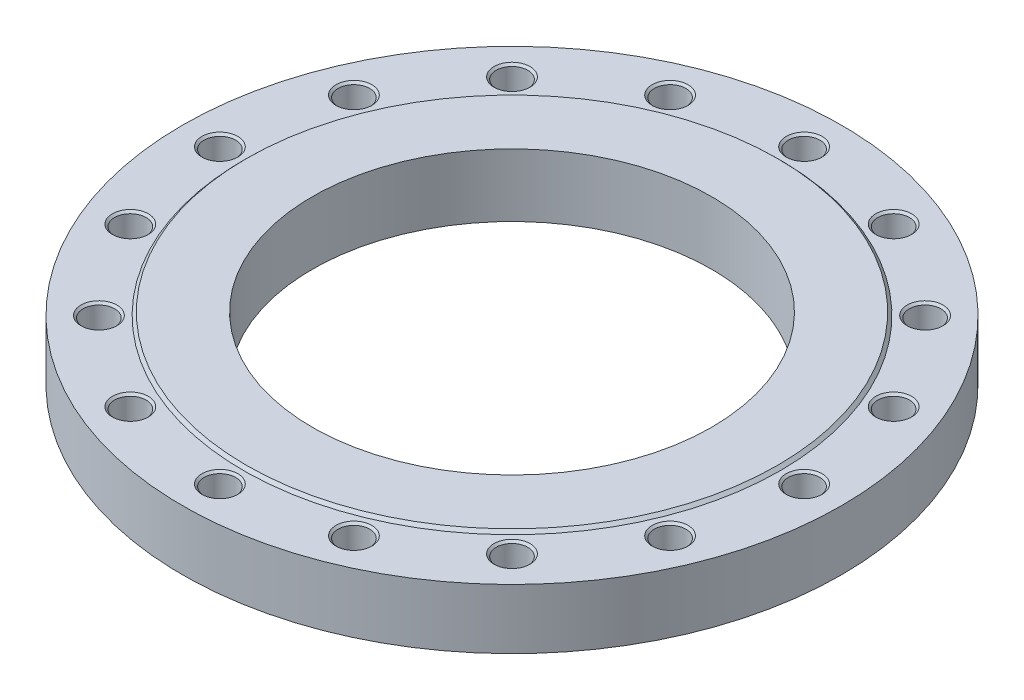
ISO-10303-21;
HEADER;
FILE_DESCRIPTION(('STEP AP214'),'2;1');
FILE_NAME('part.step','',(''),(''),'','','');
FILE_SCHEMA(('AUTOMOTIVE_DESIGN { 1 0 10303 214 1 1 1 1 }'));
ENDSEC;
DATA;
#1=APPLICATION_CONTEXT('core data for automotive mechanical design processes');
#2=APPLICATION_PROTOCOL_DEFINITION('international standard','automotive_design',2000,#1);
#3=PRODUCT_CONTEXT('',#1,'mechanical');
#4=PRODUCT('Part','Part','',(#3));
#5=PRODUCT_RELATED_PRODUCT_CATEGORY('part','',(#4));
#6=PRODUCT_DEFINITION_FORMATION('','',#4);
#7=PRODUCT_DEFINITION_CONTEXT('part definition',#1,'design');
#8=PRODUCT_DEFINITION('design','',#6,#7);
#9=PRODUCT_DEFINITION_SHAPE('','',#8);
#10=(LENGTH_UNIT() NAMED_UNIT(*) SI_UNIT(.MILLI.,.METRE.));
#11=(NAMED_UNIT(*) PLANE_ANGLE_UNIT() SI_UNIT($,.RADIAN.));
#12=(NAMED_UNIT(*) SI_UNIT($,.STERADIAN.) SOLID_ANGLE_UNIT());
#13=UNCERTAINTY_MEASURE_WITH_UNIT(LENGTH_MEASURE(1.E-05),#10,'distance_accuracy_value','');
#14=(GEOMETRIC_REPRESENTATION_CONTEXT(3) GLOBAL_UNCERTAINTY_ASSIGNED_CONTEXT((#13)) GLOBAL_UNIT_ASSIGNED_CONTEXT((#10,
#11,#12)) REPRESENTATION_CONTEXT('',''));
#15=CARTESIAN_POINT('',(0.,0.,0.));
#16=DIRECTION('',(0.,0.,1.));
#17=DIRECTION('',(1.,0.,0.));
#18=AXIS2_PLACEMENT_3D('',#15,#16,#17);
#19=CARTESIAN_POINT('',(0.,30.,0.));
#20=DIRECTION('',(0.,-1.,0.));
#21=DIRECTION('',(1.,0.,0.));
#22=AXIS2_PLACEMENT_3D('',#19,#20,#21);
#23=CYLINDRICAL_SURFACE('',#22,330.);
#24=CARTESIAN_POINT('',(0.,0.,0.));
#25=DIRECTION('',(0.,1.,0.));
#26=DIRECTION('',(1.,0.,0.));
#27=AXIS2_PLACEMENT_3D('',#24,#25,#26);
#28=CIRCLE('',#27,330.);
#29=CARTESIAN_POINT('',(330.,0.,0.));
#30=VERTEX_POINT('',#29);
#31=EDGE_CURVE('E9',#30,#30,#28,.T.);
#32=ORIENTED_EDGE('',*,*,#31,.T.);
#33=EDGE_LOOP('',(#32));
#34=FACE_BOUND('',#33,.T.);
#35=CARTESIAN_POINT('',(0.,60.,0.));
#36=DIRECTION('',(0.,1.,0.));
#37=DIRECTION('',(1.,0.,0.));
#38=AXIS2_PLACEMENT_3D('',#35,#36,#37);
#39=CIRCLE('',#38,330.);
#40=CARTESIAN_POINT('',(330.,60.,0.));
#41=VERTEX_POINT('',#40);
#42=EDGE_CURVE('E111',#41,#41,#39,.T.);
#43=ORIENTED_EDGE('',*,*,#42,.F.);
#44=EDGE_LOOP('',(#43));
#45=FACE_BOUND('',#44,.T.);
#46=ADVANCED_FACE('F15',(#34,#45),#23,.T.);
#47=CARTESIAN_POINT('',(265.,0.,0.));
#48=DIRECTION('',(0.,-1.,0.));
#49=DIRECTION('',(-1.,0.,0.));
#50=AXIS2_PLACEMENT_3D('',#47,#48,#49);
#51=PLANE('',#50);
#52=CARTESIAN_POINT('',(0.,0.,0.));
#53=DIRECTION('',(0.,1.,0.));
#54=DIRECTION('',(1.,0.,0.));
#55=AXIS2_PLACEMENT_3D('',#52,#53,#54);
#56=CIRCLE('',#55,200.);
#57=CARTESIAN_POINT('',(200.,0.,0.));
#58=VERTEX_POINT('',#57);
#59=EDGE_CURVE('E24',#58,#58,#56,.T.);
#60=ORIENTED_EDGE('',*,*,#59,.T.);
#61=EDGE_LOOP('',(#60));
#62=FACE_BOUND('',#61,.T.);
#63=ORIENTED_EDGE('',*,*,#31,.F.);
#64=EDGE_LOOP('',(#63));
#65=FACE_BOUND('',#64,.T.);
#66=ADVANCED_FACE('F458',(#62,#65),#51,.T.);
#67=CARTESIAN_POINT('',(0.,31.5,0.));
#68=DIRECTION('',(0.,-1.,0.));
#69=DIRECTION('',(1.,0.,0.));
#70=AXIS2_PLACEMENT_3D('',#67,#68,#69);
#71=CYLINDRICAL_SURFACE('',#70,200.);
#72=CARTESIAN_POINT('',(0.,63.,0.));
#73=DIRECTION('',(0.,1.,0.));
#74=DIRECTION('',(1.,0.,0.));
#75=AXIS2_PLACEMENT_3D('',#72,#73,#74);
#76=CIRCLE('',#75,200.);
#77=CARTESIAN_POINT('',(200.,63.,0.));
#78=VERTEX_POINT('',#77);
#79=EDGE_CURVE('E19',#78,#78,#76,.T.);
#80=ORIENTED_EDGE('',*,*,#79,.T.);
#81=EDGE_LOOP('',(#80));
#82=FACE_BOUND('',#81,.T.);
#83=ORIENTED_EDGE('',*,*,#59,.F.);
#84=EDGE_LOOP('',(#83));
#85=FACE_BOUND('',#84,.T.);
#86=ADVANCED_FACE('F17',(#82,#85),#71,.F.);
#87=CARTESIAN_POINT('',(233.,63.,0.));
#88=DIRECTION('',(0.,1.,0.));
#89=DIRECTION('',(1.,0.,0.));
#90=AXIS2_PLACEMENT_3D('',#87,#88,#89);
#91=PLANE('',#90);
#92=CARTESIAN_POINT('',(0.,63.,0.));
#93=DIRECTION('',(0.,1.,0.));
#94=DIRECTION('',(1.,0.,0.));
#95=AXIS2_PLACEMENT_3D('',#92,#93,#94);
#96=CIRCLE('',#95,266.);
#97=CARTESIAN_POINT('',(266.,63.,0.));
#98=VERTEX_POINT('',#97);
#99=EDGE_CURVE('E440',#98,#98,#96,.T.);
#100=ORIENTED_EDGE('',*,*,#99,.T.);
#101=EDGE_LOOP('',(#100));
#102=FACE_BOUND('',#101,.T.);
#103=ORIENTED_EDGE('',*,*,#79,.F.);
#104=EDGE_LOOP('',(#103));
#105=FACE_BOUND('',#104,.T.);
#106=ADVANCED_FACE('F447',(#102,#105),#91,.T.);
#107=CARTESIAN_POINT('',(0.,61.5,0.));
#108=DIRECTION('',(0.,-1.,0.));
#109=DIRECTION('',(1.,0.,0.));
#110=AXIS2_PLACEMENT_3D('',#107,#108,#109);
#111=CONICAL_SURFACE('',#110,267.5,0.785398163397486);
#112=CARTESIAN_POINT('',(0.,60.,0.));
#113=DIRECTION('',(0.,1.,0.));
#114=DIRECTION('',(1.,0.,0.));
#115=AXIS2_PLACEMENT_3D('',#112,#113,#114);
#116=CIRCLE('',#115,269.);
#117=CARTESIAN_POINT('',(269.,60.,0.));
#118=VERTEX_POINT('',#117);
#119=EDGE_CURVE('E118',#118,#118,#116,.T.);
#120=ORIENTED_EDGE('',*,*,#119,.T.);
#121=EDGE_LOOP('',(#120));
#122=FACE_BOUND('',#121,.T.);
#123=ORIENTED_EDGE('',*,*,#99,.F.);
#124=EDGE_LOOP('',(#123));
#125=FACE_BOUND('',#124,.T.);
#126=ADVANCED_FACE('F449',(#122,#125),#111,.T.);
#127=CARTESIAN_POINT('',(299.5,60.,0.));
#128=DIRECTION('',(0.,1.,0.));
#129=DIRECTION('',(1.,0.,0.));
#130=AXIS2_PLACEMENT_3D('',#127,#128,#129);
#131=PLANE('',#130);
#132=ORIENTED_EDGE('',*,*,#42,.T.);
#133=EDGE_LOOP('',(#132));
#134=FACE_BOUND('',#133,.T.);
#135=ORIENTED_EDGE('',*,*,#119,.F.);
#136=EDGE_LOOP('',(#135));
#137=FACE_BOUND('',#136,.T.);
#138=CARTESIAN_POINT('',(292.5,60.,0.));
#139=DIRECTION('',(0.,-1.,0.));
#140=DIRECTION('',(1.,0.,0.));
#141=AXIS2_PLACEMENT_3D('',#138,#139,#140);
#142=CIRCLE('',#141,18.);
#143=CARTESIAN_POINT('',(310.5,60.,0.));
#144=VERTEX_POINT('',#143);
#145=EDGE_CURVE('E431',#144,#144,#142,.T.);
#146=ORIENTED_EDGE('',*,*,#145,.T.);
#147=EDGE_LOOP('',(#146));
#148=FACE_BOUND('',#147,.T.);
#149=CARTESIAN_POINT('',(270.234763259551,60.,-111.934903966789));
#150=DIRECTION('',(0.,-1.,0.));
#151=DIRECTION('',(0.923879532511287,0.,-0.38268343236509));
#152=AXIS2_PLACEMENT_3D('',#149,#150,#151);
#153=CIRCLE('',#152,18.);
#154=CARTESIAN_POINT('',(286.864594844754,60.,-118.82320574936));
#155=VERTEX_POINT('',#154);
#156=EDGE_CURVE('E425',#155,#155,#153,.T.);
#157=ORIENTED_EDGE('',*,*,#156,.T.);
#158=EDGE_LOOP('',(#157));
#159=FACE_BOUND('',#158,.T.);
#160=CARTESIAN_POINT('',(206.828733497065,60.,-206.828733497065));
#161=DIRECTION('',(0.,-1.,0.));
#162=DIRECTION('',(0.707106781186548,0.,-0.707106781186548));
#163=AXIS2_PLACEMENT_3D('',#160,#161,#162);
#164=CIRCLE('',#163,18.);
#165=CARTESIAN_POINT('',(219.556655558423,60.,-219.556655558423));
#166=VERTEX_POINT('',#165);
#167=EDGE_CURVE('E416',#166,#166,#164,.T.);
#168=ORIENTED_EDGE('',*,*,#167,.T.);
#169=EDGE_LOOP('',(#168));
#170=FACE_BOUND('',#169,.T.);
#171=CARTESIAN_POINT('',(111.934903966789,60.,-270.234763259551));
#172=DIRECTION('',(0.,-1.,0.));
#173=DIRECTION('',(0.38268343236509,0.,-0.923879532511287));
#174=AXIS2_PLACEMENT_3D('',#171,#172,#173);
#175=CIRCLE('',#174,18.);
#176=CARTESIAN_POINT('',(118.82320574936,60.,-286.864594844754));
#177=VERTEX_POINT('',#176);
#178=EDGE_CURVE('E411',#177,#177,#175,.T.);
#179=ORIENTED_EDGE('',*,*,#178,.T.);
#180=EDGE_LOOP('',(#179));
#181=FACE_BOUND('',#180,.T.);
#182=CARTESIAN_POINT('',(0.,60.,-292.5));
#183=DIRECTION('',(0.,-1.,0.));
#184=DIRECTION('',(0.,0.,-1.));
#185=AXIS2_PLACEMENT_3D('',#182,#183,#184);
#186=CIRCLE('',#185,18.);
#187=CARTESIAN_POINT('',(0.,60.,-310.5));
#188=VERTEX_POINT('',#187);
#189=EDGE_CURVE('E399',#188,#188,#186,.T.);
#190=ORIENTED_EDGE('',*,*,#189,.T.);
#191=EDGE_LOOP('',(#190));
#192=FACE_BOUND('',#191,.T.);
#193=CARTESIAN_POINT('',(-111.934903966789,60.,-270.234763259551));
#194=DIRECTION('',(0.,-1.,0.));
#195=DIRECTION('',(-0.38268343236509,0.,-0.923879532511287));
#196=AXIS2_PLACEMENT_3D('',#193,#194,#195);
#197=CIRCLE('',#196,18.);
#198=CARTESIAN_POINT('',(-118.82320574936,60.,-286.864594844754));
#199=VERTEX_POINT('',#198);
#200=EDGE_CURVE('E387',#199,#199,#197,.T.);
#201=ORIENTED_EDGE('',*,*,#200,.T.);
#202=EDGE_LOOP('',(#201));
#203=FACE_BOUND('',#202,.T.);
#204=CARTESIAN_POINT('',(-206.828733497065,60.,-206.828733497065));
#205=DIRECTION('',(0.,-1.,0.));
#206=DIRECTION('',(-0.707106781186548,0.,-0.707106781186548));
#207=AXIS2_PLACEMENT_3D('',#204,#205,#206);
#208=CIRCLE('',#207,18.);
#209=CARTESIAN_POINT('',(-219.556655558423,60.,-219.556655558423));
#210=VERTEX_POINT('',#209);
#211=EDGE_CURVE('E371',#210,#210,#208,.T.);
#212=ORIENTED_EDGE('',*,*,#211,.T.);
#213=EDGE_LOOP('',(#212));
#214=FACE_BOUND('',#213,.T.);
#215=CARTESIAN_POINT('',(-270.234763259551,60.,-111.934903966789));
#216=DIRECTION('',(0.,-1.,0.));
#217=DIRECTION('',(-0.923879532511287,0.,-0.38268343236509));
#218=AXIS2_PLACEMENT_3D('',#215,#216,#217);
#219=CIRCLE('',#218,18.);
#220=CARTESIAN_POINT('',(-286.864594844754,60.,-118.82320574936));
#221=VERTEX_POINT('',#220);
#222=EDGE_CURVE('E360',#221,#221,#219,.T.);
#223=ORIENTED_EDGE('',*,*,#222,.T.);
#224=EDGE_LOOP('',(#223));
#225=FACE_BOUND('',#224,.T.);
#226=CARTESIAN_POINT('',(-292.5,60.,0.));
#227=DIRECTION('',(0.,-1.,0.));
#228=DIRECTION('',(-1.,0.,0.));
#229=AXIS2_PLACEMENT_3D('',#226,#227,#228);
#230=CIRCLE('',#229,18.);
#231=CARTESIAN_POINT('',(-310.5,60.,0.));
#232=VERTEX_POINT('',#231);
#233=EDGE_CURVE('E552',#232,#232,#230,.T.);
#234=ORIENTED_EDGE('',*,*,#233,.T.);
#235=EDGE_LOOP('',(#234));
#236=FACE_BOUND('',#235,.T.);
#237=CARTESIAN_POINT('',(-270.234763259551,60.,111.934903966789));
#238=DIRECTION('',(0.,-1.,0.));
#239=DIRECTION('',(-0.923879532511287,0.,0.38268343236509));
#240=AXIS2_PLACEMENT_3D('',#237,#238,#239);
#241=CIRCLE('',#240,18.);
#242=CARTESIAN_POINT('',(-286.864594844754,60.,118.82320574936));
#243=VERTEX_POINT('',#242);
#244=EDGE_CURVE('E555',#243,#243,#241,.T.);
#245=ORIENTED_EDGE('',*,*,#244,.T.);
#246=EDGE_LOOP('',(#245));
#247=FACE_BOUND('',#246,.T.);
#248=CARTESIAN_POINT('',(-206.828733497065,60.,206.828733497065));
#249=DIRECTION('',(0.,-1.,0.));
#250=DIRECTION('',(-0.707106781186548,0.,0.707106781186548));
#251=AXIS2_PLACEMENT_3D('',#248,#249,#250);
#252=CIRCLE('',#251,18.);
#253=CARTESIAN_POINT('',(-219.556655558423,60.,219.556655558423));
#254=VERTEX_POINT('',#253);
#255=EDGE_CURVE('E558',#254,#254,#252,.T.);
#256=ORIENTED_EDGE('',*,*,#255,.T.);
#257=EDGE_LOOP('',(#256));
#258=FACE_BOUND('',#257,.T.);
#259=CARTESIAN_POINT('',(-111.934903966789,60.,270.234763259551));
#260=DIRECTION('',(0.,-1.,0.));
#261=DIRECTION('',(-0.382683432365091,0.,0.923879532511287));
#262=AXIS2_PLACEMENT_3D('',#259,#260,#261);
#263=CIRCLE('',#262,18.);
#264=CARTESIAN_POINT('',(-118.82320574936,60.,286.864594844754));
#265=VERTEX_POINT('',#264);
#266=EDGE_CURVE('E561',#265,#265,#263,.T.);
#267=ORIENTED_EDGE('',*,*,#266,.T.);
#268=EDGE_LOOP('',(#267));
#269=FACE_BOUND('',#268,.T.);
#270=CARTESIAN_POINT('',(0.,60.,292.5));
#271=DIRECTION('',(0.,-1.,0.));
#272=DIRECTION('',(0.,0.,1.));
#273=AXIS2_PLACEMENT_3D('',#270,#271,#272);
#274=CIRCLE('',#273,18.);
#275=CARTESIAN_POINT('',(0.,60.,310.5));
#276=VERTEX_POINT('',#275);
#277=EDGE_CURVE('E564',#276,#276,#274,.T.);
#278=ORIENTED_EDGE('',*,*,#277,.T.);
#279=EDGE_LOOP('',(#278));
#280=FACE_BOUND('',#279,.T.);
#281=CARTESIAN_POINT('',(111.934903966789,60.,270.234763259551));
#282=DIRECTION('',(0.,-1.,0.));
#283=DIRECTION('',(0.38268343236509,0.,0.923879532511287));
#284=AXIS2_PLACEMENT_3D('',#281,#282,#283);
#285=CIRCLE('',#284,18.);
#286=CARTESIAN_POINT('',(118.82320574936,60.,286.864594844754));
#287=VERTEX_POINT('',#286);
#288=EDGE_CURVE('E568',#287,#287,#285,.T.);
#289=ORIENTED_EDGE('',*,*,#288,.T.);
#290=EDGE_LOOP('',(#289));
#291=FACE_BOUND('',#290,.T.);
#292=CARTESIAN_POINT('',(206.828733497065,60.,206.828733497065));
#293=DIRECTION('',(0.,-1.,0.));
#294=DIRECTION('',(0.707106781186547,0.,0.707106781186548));
#295=AXIS2_PLACEMENT_3D('',#292,#293,#294);
#296=CIRCLE('',#295,18.);
#297=CARTESIAN_POINT('',(219.556655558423,60.,219.556655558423));
#298=VERTEX_POINT('',#297);
#299=EDGE_CURVE('E572',#298,#298,#296,.T.);
#300=ORIENTED_EDGE('',*,*,#299,.T.);
#301=EDGE_LOOP('',(#300));
#302=FACE_BOUND('',#301,.T.);
#303=CARTESIAN_POINT('',(270.234763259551,60.,111.934903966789));
#304=DIRECTION('',(0.,-1.,0.));
#305=DIRECTION('',(0.923879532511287,0.,0.382683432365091));
#306=AXIS2_PLACEMENT_3D('',#303,#304,#305);
#307=CIRCLE('',#306,18.);
#308=CARTESIAN_POINT('',(286.864594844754,60.,118.823205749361));
#309=VERTEX_POINT('',#308);
#310=EDGE_CURVE('E576',#309,#309,#307,.T.);
#311=ORIENTED_EDGE('',*,*,#310,.T.);
#312=EDGE_LOOP('',(#311));
#313=FACE_BOUND('',#312,.T.);
#314=ADVANCED_FACE('F456',(#134,#137,#148,#159,#170,#181,#192,#203,#214,#225,#236,#247,#258,
#269,#280,#291,#302,#313),#131,.T.);
#315=CARTESIAN_POINT('',(292.5,8.42882924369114,0.));
#316=DIRECTION('',(0.,1.,0.));
#317=DIRECTION('',(1.,0.,0.));
#318=AXIS2_PLACEMENT_3D('',#315,#316,#317);
#319=CONICAL_SURFACE('',#318,7.9175,1.0471975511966);
#320=CARTESIAN_POINT('',(292.5,13.,0.));
#321=DIRECTION('',(0.,-1.,0.));
#322=DIRECTION('',(1.,0.,0.));
#323=AXIS2_PLACEMENT_3D('',#320,#321,#322);
#324=CIRCLE('',#323,15.835);
#325=CARTESIAN_POINT('',(308.335,13.,0.));
#326=VERTEX_POINT('',#325);
#327=EDGE_CURVE('E437',#326,#326,#324,.T.);
#328=ORIENTED_EDGE('',*,*,#327,.F.);
#329=EDGE_LOOP('',(#328));
#330=FACE_BOUND('',#329,.T.);
#331=CARTESIAN_POINT('',(292.5,3.85765848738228,0.));
#332=VERTEX_POINT('',#331);
#333=VERTEX_LOOP('',#332);
#334=FACE_BOUND('',#333,.T.);
#335=ADVANCED_FACE('F525',(#330,#334),#319,.F.);
#336=CARTESIAN_POINT('',(292.5,17.9175,0.));
#337=DIRECTION('',(0.,1.,0.));
#338=DIRECTION('',(1.,0.,0.));
#339=AXIS2_PLACEMENT_3D('',#336,#337,#338);
#340=CYLINDRICAL_SURFACE('',#339,15.835);
#341=CARTESIAN_POINT('',(292.5,22.835,0.));
#342=DIRECTION('',(0.,-1.,0.));
#343=DIRECTION('',(1.,0.,0.));
#344=AXIS2_PLACEMENT_3D('',#341,#342,#343);
#345=CIRCLE('',#344,15.835);
#346=CARTESIAN_POINT('',(308.335,22.835,0.));
#347=VERTEX_POINT('',#346);
#348=EDGE_CURVE('E436',#347,#347,#345,.T.);
#349=ORIENTED_EDGE('',*,*,#348,.F.);
#350=EDGE_LOOP('',(#349));
#351=FACE_BOUND('',#350,.T.);
#352=ORIENTED_EDGE('',*,*,#327,.T.);
#353=EDGE_LOOP('',(#352));
#354=FACE_BOUND('',#353,.T.);
#355=ADVANCED_FACE('F529',(#351,#354),#340,.F.);
#356=CARTESIAN_POINT('',(292.5,23.9175,0.));
#357=DIRECTION('',(0.,1.,0.));
#358=DIRECTION('',(1.,0.,0.));
#359=AXIS2_PLACEMENT_3D('',#356,#357,#358);
#360=CONICAL_SURFACE('',#359,16.9175,0.785398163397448);
#361=CARTESIAN_POINT('',(292.5,25.,0.));
#362=DIRECTION('',(0.,-1.,0.));
#363=DIRECTION('',(1.,0.,0.));
#364=AXIS2_PLACEMENT_3D('',#361,#362,#363);
#365=CIRCLE('',#364,18.);
#366=CARTESIAN_POINT('',(310.5,25.,0.));
#367=VERTEX_POINT('',#366);
#368=EDGE_CURVE('E434',#367,#367,#365,.T.);
#369=ORIENTED_EDGE('',*,*,#368,.F.);
#370=EDGE_LOOP('',(#369));
#371=FACE_BOUND('',#370,.T.);
#372=ORIENTED_EDGE('',*,*,#348,.T.);
#373=EDGE_LOOP('',(#372));
#374=FACE_BOUND('',#373,.T.);
#375=ADVANCED_FACE('F709',(#371,#374),#360,.F.);
#376=CARTESIAN_POINT('',(309.4175,25.,0.));
#377=DIRECTION('',(0.,1.,0.));
#378=DIRECTION('',(-1.,0.,0.));
#379=AXIS2_PLACEMENT_3D('',#376,#377,#378);
#380=PLANE('',#379);
#381=CARTESIAN_POINT('',(292.5,25.,0.));
#382=DIRECTION('',(0.,-1.,0.));
#383=DIRECTION('',(1.,0.,0.));
#384=AXIS2_PLACEMENT_3D('',#381,#382,#383);
#385=CIRCLE('',#384,15.835);
#386=CARTESIAN_POINT('',(308.335,25.,0.));
#387=VERTEX_POINT('',#386);
#388=EDGE_CURVE('E433',#387,#387,#385,.T.);
#389=ORIENTED_EDGE('',*,*,#388,.F.);
#390=EDGE_LOOP('',(#389));
#391=FACE_BOUND('',#390,.T.);
#392=ORIENTED_EDGE('',*,*,#368,.T.);
#393=EDGE_LOOP('',(#392));
#394=FACE_BOUND('',#393,.T.);
#395=ADVANCED_FACE('F748',(#391,#394),#380,.F.);
#396=CARTESIAN_POINT('',(292.5,41.4175,0.));
#397=DIRECTION('',(0.,1.,0.));
#398=DIRECTION('',(1.,0.,0.));
#399=AXIS2_PLACEMENT_3D('',#396,#397,#398);
#400=CYLINDRICAL_SURFACE('',#399,15.835);
#401=CARTESIAN_POINT('',(292.5,57.835,0.));
#402=DIRECTION('',(0.,-1.,0.));
#403=DIRECTION('',(1.,0.,0.));
#404=AXIS2_PLACEMENT_3D('',#401,#402,#403);
#405=CIRCLE('',#404,15.835);
#406=CARTESIAN_POINT('',(308.335,57.835,0.));
#407=VERTEX_POINT('',#406);
#408=EDGE_CURVE('E428',#407,#407,#405,.T.);
#409=ORIENTED_EDGE('',*,*,#408,.F.);
#410=EDGE_LOOP('',(#409));
#411=FACE_BOUND('',#410,.T.);
#412=ORIENTED_EDGE('',*,*,#388,.T.);
#413=EDGE_LOOP('',(#412));
#414=FACE_BOUND('',#413,.T.);
#415=ADVANCED_FACE('F522',(#411,#414),#400,.F.);
#416=CARTESIAN_POINT('',(292.5,58.9175,0.));
#417=DIRECTION('',(0.,1.,0.));
#418=DIRECTION('',(1.,0.,0.));
#419=AXIS2_PLACEMENT_3D('',#416,#417,#418);
#420=CONICAL_SURFACE('',#419,16.9175,0.785398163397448);
#421=ORIENTED_EDGE('',*,*,#145,.F.);
#422=EDGE_LOOP('',(#421));
#423=FACE_BOUND('',#422,.T.);
#424=ORIENTED_EDGE('',*,*,#408,.T.);
#425=EDGE_LOOP('',(#424));
#426=FACE_BOUND('',#425,.T.);
#427=ADVANCED_FACE('F519',(#423,#426),#420,.F.);
#428=CARTESIAN_POINT('',(270.234763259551,8.42882924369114,-111.934903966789));
#429=DIRECTION('',(0.,1.,0.));
#430=DIRECTION('',(0.923879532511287,0.,-0.38268343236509));
#431=AXIS2_PLACEMENT_3D('',#428,#429,#430);
#432=CONICAL_SURFACE('',#431,7.9175,1.0471975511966);
#433=CARTESIAN_POINT('',(270.234763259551,13.,-111.934903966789));
#434=DIRECTION('',(0.,-1.,0.));
#435=DIRECTION('',(0.923879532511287,0.,-0.38268343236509));
#436=AXIS2_PLACEMENT_3D('',#433,#434,#435);
#437=CIRCLE('',#436,15.835);
#438=CARTESIAN_POINT('',(284.864395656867,13.,-117.99469611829));
#439=VERTEX_POINT('',#438);
#440=EDGE_CURVE('E426',#439,#439,#437,.T.);
#441=ORIENTED_EDGE('',*,*,#440,.F.);
#442=EDGE_LOOP('',(#441));
#443=FACE_BOUND('',#442,.T.);
#444=CARTESIAN_POINT('',(270.234763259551,3.85765848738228,-111.934903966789));
#445=VERTEX_POINT('',#444);
#446=VERTEX_LOOP('',#445);
#447=FACE_BOUND('',#446,.T.);
#448=ADVANCED_FACE('F516',(#443,#447),#432,.F.);
#449=CARTESIAN_POINT('',(270.234763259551,17.9175,-111.934903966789));
#450=DIRECTION('',(0.,1.,0.));
#451=DIRECTION('',(0.923879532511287,0.,-0.38268343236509));
#452=AXIS2_PLACEMENT_3D('',#449,#450,#451);
#453=CYLINDRICAL_SURFACE('',#452,15.835);
#454=CARTESIAN_POINT('',(270.234763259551,22.835,-111.934903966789));
#455=DIRECTION('',(0.,-1.,0.));
#456=DIRECTION('',(0.923879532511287,0.,-0.38268343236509));
#457=AXIS2_PLACEMENT_3D('',#454,#455,#456);
#458=CIRCLE('',#457,15.835);
#459=CARTESIAN_POINT('',(284.864395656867,22.835,-117.99469611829));
#460=VERTEX_POINT('',#459);
#461=EDGE_CURVE('E429',#460,#460,#458,.T.);
#462=ORIENTED_EDGE('',*,*,#461,.F.);
#463=EDGE_LOOP('',(#462));
#464=FACE_BOUND('',#463,.T.);
#465=ORIENTED_EDGE('',*,*,#440,.T.);
#466=EDGE_LOOP('',(#465));
#467=FACE_BOUND('',#466,.T.);
#468=ADVANCED_FACE('F514',(#464,#467),#453,.F.);
#469=CARTESIAN_POINT('',(270.234763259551,23.9175,-111.934903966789));
#470=DIRECTION('',(0.,1.,0.));
#471=DIRECTION('',(0.923879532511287,0.,-0.38268343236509));
#472=AXIS2_PLACEMENT_3D('',#469,#470,#471);
#473=CONICAL_SURFACE('',#472,16.9175,0.785398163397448);
#474=CARTESIAN_POINT('',(270.234763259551,25.,-111.934903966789));
#475=DIRECTION('',(0.,-1.,0.));
#476=DIRECTION('',(0.923879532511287,0.,-0.38268343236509));
#477=AXIS2_PLACEMENT_3D('',#474,#475,#476);
#478=CIRCLE('',#477,18.);
#479=CARTESIAN_POINT('',(286.864594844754,25.,-118.82320574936));
#480=VERTEX_POINT('',#479);
#481=EDGE_CURVE('E628',#480,#480,#478,.T.);
#482=ORIENTED_EDGE('',*,*,#481,.F.);
#483=EDGE_LOOP('',(#482));
#484=FACE_BOUND('',#483,.T.);
#485=ORIENTED_EDGE('',*,*,#461,.T.);
#486=EDGE_LOOP('',(#485));
#487=FACE_BOUND('',#486,.T.);
#488=ADVANCED_FACE('F510',(#484,#487),#473,.F.);
#489=CARTESIAN_POINT('',(285.864495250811,25.,-118.408950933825));
#490=DIRECTION('',(0.,1.,0.));
#491=DIRECTION('',(-0.923879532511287,0.,0.38268343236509));
#492=AXIS2_PLACEMENT_3D('',#489,#490,#491);
#493=PLANE('',#492);
#494=CARTESIAN_POINT('',(270.234763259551,25.,-111.934903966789));
#495=DIRECTION('',(0.,-1.,0.));
#496=DIRECTION('',(0.923879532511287,0.,-0.38268343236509));
#497=AXIS2_PLACEMENT_3D('',#494,#495,#496);
#498=CIRCLE('',#497,15.835);
#499=CARTESIAN_POINT('',(284.864395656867,25.,-117.99469611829));
#500=VERTEX_POINT('',#499);
#501=EDGE_CURVE('E625',#500,#500,#498,.T.);
#502=ORIENTED_EDGE('',*,*,#501,.F.);
#503=EDGE_LOOP('',(#502));
#504=FACE_BOUND('',#503,.T.);
#505=ORIENTED_EDGE('',*,*,#481,.T.);
#506=EDGE_LOOP('',(#505));
#507=FACE_BOUND('',#506,.T.);
#508=ADVANCED_FACE('F513',(#504,#507),#493,.F.);
#509=CARTESIAN_POINT('',(270.234763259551,41.4175,-111.934903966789));
#510=DIRECTION('',(0.,1.,0.));
#511=DIRECTION('',(0.923879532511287,0.,-0.38268343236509));
#512=AXIS2_PLACEMENT_3D('',#509,#510,#511);
#513=CYLINDRICAL_SURFACE('',#512,15.835);
#514=CARTESIAN_POINT('',(270.234763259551,57.835,-111.934903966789));
#515=DIRECTION('',(0.,-1.,0.));
#516=DIRECTION('',(0.923879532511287,0.,-0.38268343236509));
#517=AXIS2_PLACEMENT_3D('',#514,#515,#516);
#518=CIRCLE('',#517,15.835);
#519=CARTESIAN_POINT('',(284.864395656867,57.835,-117.99469611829));
#520=VERTEX_POINT('',#519);
#521=EDGE_CURVE('E423',#520,#520,#518,.T.);
#522=ORIENTED_EDGE('',*,*,#521,.F.);
#523=EDGE_LOOP('',(#522));
#524=FACE_BOUND('',#523,.T.);
#525=ORIENTED_EDGE('',*,*,#501,.T.);
#526=EDGE_LOOP('',(#525));
#527=FACE_BOUND('',#526,.T.);
#528=ADVANCED_FACE('F508',(#524,#527),#513,.F.);
#529=CARTESIAN_POINT('',(270.234763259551,58.9175,-111.934903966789));
#530=DIRECTION('',(0.,1.,0.));
#531=DIRECTION('',(0.923879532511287,0.,-0.38268343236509));
#532=AXIS2_PLACEMENT_3D('',#529,#530,#531);
#533=CONICAL_SURFACE('',#532,16.9175,0.785398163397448);
#534=ORIENTED_EDGE('',*,*,#156,.F.);
#535=EDGE_LOOP('',(#534));
#536=FACE_BOUND('',#535,.T.);
#537=ORIENTED_EDGE('',*,*,#521,.T.);
#538=EDGE_LOOP('',(#537));
#539=FACE_BOUND('',#538,.T.);
#540=ADVANCED_FACE('F504',(#536,#539),#533,.F.);
#541=CARTESIAN_POINT('',(206.828733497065,8.42882924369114,-206.828733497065));
#542=DIRECTION('',(0.,1.,0.));
#543=DIRECTION('',(0.707106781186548,0.,-0.707106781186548));
#544=AXIS2_PLACEMENT_3D('',#541,#542,#543);
#545=CONICAL_SURFACE('',#544,7.9175,1.0471975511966);
#546=CARTESIAN_POINT('',(206.828733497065,13.,-206.828733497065));
#547=DIRECTION('',(0.,-1.,0.));
#548=DIRECTION('',(0.707106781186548,0.,-0.707106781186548));
#549=AXIS2_PLACEMENT_3D('',#546,#547,#548);
#550=CIRCLE('',#549,15.835);
#551=CARTESIAN_POINT('',(218.025769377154,13.,-218.025769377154));
#552=VERTEX_POINT('',#551);
#553=EDGE_CURVE('E422',#552,#552,#550,.T.);
#554=ORIENTED_EDGE('',*,*,#553,.F.);
#555=EDGE_LOOP('',(#554));
#556=FACE_BOUND('',#555,.T.);
#557=CARTESIAN_POINT('',(206.828733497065,3.85765848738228,-206.828733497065));
#558=VERTEX_POINT('',#557);
#559=VERTEX_LOOP('',#558);
#560=FACE_BOUND('',#559,.T.);
#561=ADVANCED_FACE('F507',(#556,#560),#545,.F.);
#562=CARTESIAN_POINT('',(206.828733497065,17.9175,-206.828733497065));
#563=DIRECTION('',(0.,1.,0.));
#564=DIRECTION('',(0.707106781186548,0.,-0.707106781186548));
#565=AXIS2_PLACEMENT_3D('',#562,#563,#564);
#566=CYLINDRICAL_SURFACE('',#565,15.835);
#567=CARTESIAN_POINT('',(206.828733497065,22.835,-206.828733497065));
#568=DIRECTION('',(0.,-1.,0.));
#569=DIRECTION('',(0.707106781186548,0.,-0.707106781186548));
#570=AXIS2_PLACEMENT_3D('',#567,#568,#569);
#571=CIRCLE('',#570,15.835);
#572=CARTESIAN_POINT('',(218.025769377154,22.835,-218.025769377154));
#573=VERTEX_POINT('',#572);
#574=EDGE_CURVE('E420',#573,#573,#571,.T.);
#575=ORIENTED_EDGE('',*,*,#574,.F.);
#576=EDGE_LOOP('',(#575));
#577=FACE_BOUND('',#576,.T.);
#578=ORIENTED_EDGE('',*,*,#553,.T.);
#579=EDGE_LOOP('',(#578));
#580=FACE_BOUND('',#579,.T.);
#581=ADVANCED_FACE('F883',(#577,#580),#566,.F.);
#582=CARTESIAN_POINT('',(206.828733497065,23.9175,-206.828733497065));
#583=DIRECTION('',(0.,1.,0.));
#584=DIRECTION('',(0.707106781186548,0.,-0.707106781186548));
#585=AXIS2_PLACEMENT_3D('',#582,#583,#584);
#586=CONICAL_SURFACE('',#585,16.9175,0.785398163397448);
#587=CARTESIAN_POINT('',(206.828733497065,25.,-206.828733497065));
#588=DIRECTION('',(0.,-1.,0.));
#589=DIRECTION('',(0.707106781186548,0.,-0.707106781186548));
#590=AXIS2_PLACEMENT_3D('',#587,#588,#589);
#591=CIRCLE('',#590,18.);
#592=CARTESIAN_POINT('',(219.556655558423,25.,-219.556655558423));
#593=VERTEX_POINT('',#592);
#594=EDGE_CURVE('E419',#593,#593,#591,.T.);
#595=ORIENTED_EDGE('',*,*,#594,.F.);
#596=EDGE_LOOP('',(#595));
#597=FACE_BOUND('',#596,.T.);
#598=ORIENTED_EDGE('',*,*,#574,.T.);
#599=EDGE_LOOP('',(#598));
#600=FACE_BOUND('',#599,.T.);
#601=ADVANCED_FACE('F875',(#597,#600),#586,.F.);
#602=CARTESIAN_POINT('',(218.791212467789,25.,-218.791212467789));
#603=DIRECTION('',(0.,1.,0.));
#604=DIRECTION('',(-0.707106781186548,0.,0.707106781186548));
#605=AXIS2_PLACEMENT_3D('',#602,#603,#604);
#606=PLANE('',#605);
#607=CARTESIAN_POINT('',(206.828733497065,25.,-206.828733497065));
#608=DIRECTION('',(0.,-1.,0.));
#609=DIRECTION('',(0.707106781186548,0.,-0.707106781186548));
#610=AXIS2_PLACEMENT_3D('',#607,#608,#609);
#611=CIRCLE('',#610,15.835);
#612=CARTESIAN_POINT('',(218.025769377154,25.,-218.025769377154));
#613=VERTEX_POINT('',#612);
#614=EDGE_CURVE('E417',#613,#613,#611,.T.);
#615=ORIENTED_EDGE('',*,*,#614,.F.);
#616=EDGE_LOOP('',(#615));
#617=FACE_BOUND('',#616,.T.);
#618=ORIENTED_EDGE('',*,*,#594,.T.);
#619=EDGE_LOOP('',(#618));
#620=FACE_BOUND('',#619,.T.);
#621=ADVANCED_FACE('F502',(#617,#620),#606,.F.);
#622=CARTESIAN_POINT('',(206.828733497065,41.4175,-206.828733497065));
#623=DIRECTION('',(0.,1.,0.));
#624=DIRECTION('',(0.707106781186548,0.,-0.707106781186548));
#625=AXIS2_PLACEMENT_3D('',#622,#623,#624);
#626=CYLINDRICAL_SURFACE('',#625,15.835);
#627=CARTESIAN_POINT('',(206.828733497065,57.835,-206.828733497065));
#628=DIRECTION('',(0.,-1.,0.));
#629=DIRECTION('',(0.707106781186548,0.,-0.707106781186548));
#630=AXIS2_PLACEMENT_3D('',#627,#628,#629);
#631=CIRCLE('',#630,15.835);
#632=CARTESIAN_POINT('',(218.025769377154,57.835,-218.025769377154));
#633=VERTEX_POINT('',#632);
#634=EDGE_CURVE('E414',#633,#633,#631,.T.);
#635=ORIENTED_EDGE('',*,*,#634,.F.);
#636=EDGE_LOOP('',(#635));
#637=FACE_BOUND('',#636,.T.);
#638=ORIENTED_EDGE('',*,*,#614,.T.);
#639=EDGE_LOOP('',(#638));
#640=FACE_BOUND('',#639,.T.);
#641=ADVANCED_FACE('F499',(#637,#640),#626,.F.);
#642=CARTESIAN_POINT('',(206.828733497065,58.9175,-206.828733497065));
#643=DIRECTION('',(0.,1.,0.));
#644=DIRECTION('',(0.707106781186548,0.,-0.707106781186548));
#645=AXIS2_PLACEMENT_3D('',#642,#643,#644);
#646=CONICAL_SURFACE('',#645,16.9175,0.785398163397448);
#647=ORIENTED_EDGE('',*,*,#167,.F.);
#648=EDGE_LOOP('',(#647));
#649=FACE_BOUND('',#648,.T.);
#650=ORIENTED_EDGE('',*,*,#634,.T.);
#651=EDGE_LOOP('',(#650));
#652=FACE_BOUND('',#651,.T.);
#653=ADVANCED_FACE('F497',(#649,#652),#646,.F.);
#654=CARTESIAN_POINT('',(111.934903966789,8.42882924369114,-270.234763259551));
#655=DIRECTION('',(0.,1.,0.));
#656=DIRECTION('',(0.38268343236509,0.,-0.923879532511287));
#657=AXIS2_PLACEMENT_3D('',#654,#655,#656);
#658=CONICAL_SURFACE('',#657,7.9175,1.0471975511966);
#659=CARTESIAN_POINT('',(111.934903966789,13.,-270.234763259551));
#660=DIRECTION('',(0.,-1.,0.));
#661=DIRECTION('',(0.38268343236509,0.,-0.923879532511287));
#662=AXIS2_PLACEMENT_3D('',#659,#660,#661);
#663=CIRCLE('',#662,15.835);
#664=CARTESIAN_POINT('',(117.99469611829,13.,-284.864395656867));
#665=VERTEX_POINT('',#664);
#666=EDGE_CURVE('E384',#665,#665,#663,.T.);
#667=ORIENTED_EDGE('',*,*,#666,.F.);
#668=EDGE_LOOP('',(#667));
#669=FACE_BOUND('',#668,.T.);
#670=CARTESIAN_POINT('',(111.934903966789,3.85765848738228,-270.234763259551));
#671=VERTEX_POINT('',#670);
#672=VERTEX_LOOP('',#671);
#673=FACE_BOUND('',#672,.T.);
#674=ADVANCED_FACE('F493',(#669,#673),#658,.F.);
#675=CARTESIAN_POINT('',(111.934903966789,17.9175,-270.234763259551));
#676=DIRECTION('',(0.,1.,0.));
#677=DIRECTION('',(0.38268343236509,0.,-0.923879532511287));
#678=AXIS2_PLACEMENT_3D('',#675,#676,#677);
#679=CYLINDRICAL_SURFACE('',#678,15.835);
#680=CARTESIAN_POINT('',(111.934903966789,22.835,-270.234763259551));
#681=DIRECTION('',(0.,-1.,0.));
#682=DIRECTION('',(0.38268343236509,0.,-0.923879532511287));
#683=AXIS2_PLACEMENT_3D('',#680,#681,#682);
#684=CIRCLE('',#683,15.835);
#685=CARTESIAN_POINT('',(117.99469611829,22.835,-284.864395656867));
#686=VERTEX_POINT('',#685);
#687=EDGE_CURVE('E382',#686,#686,#684,.T.);
#688=ORIENTED_EDGE('',*,*,#687,.F.);
#689=EDGE_LOOP('',(#688));
#690=FACE_BOUND('',#689,.T.);
#691=ORIENTED_EDGE('',*,*,#666,.T.);
#692=EDGE_LOOP('',(#691));
#693=FACE_BOUND('',#692,.T.);
#694=ADVANCED_FACE('F489',(#690,#693),#679,.F.);
#695=CARTESIAN_POINT('',(111.934903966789,23.9175,-270.234763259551));
#696=DIRECTION('',(0.,1.,0.));
#697=DIRECTION('',(0.38268343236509,0.,-0.923879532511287));
#698=AXIS2_PLACEMENT_3D('',#695,#696,#697);
#699=CONICAL_SURFACE('',#698,16.9175,0.785398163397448);
#700=CARTESIAN_POINT('',(111.934903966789,25.,-270.234763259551));
#701=DIRECTION('',(0.,-1.,0.));
#702=DIRECTION('',(0.38268343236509,0.,-0.923879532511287));
#703=AXIS2_PLACEMENT_3D('',#700,#701,#702);
#704=CIRCLE('',#703,18.);
#705=CARTESIAN_POINT('',(118.82320574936,25.,-286.864594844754));
#706=VERTEX_POINT('',#705);
#707=EDGE_CURVE('E385',#706,#706,#704,.T.);
#708=ORIENTED_EDGE('',*,*,#707,.F.);
#709=EDGE_LOOP('',(#708));
#710=FACE_BOUND('',#709,.T.);
#711=ORIENTED_EDGE('',*,*,#687,.T.);
#712=EDGE_LOOP('',(#711));
#713=FACE_BOUND('',#712,.T.);
#714=ADVANCED_FACE('F485',(#710,#713),#699,.F.);
#715=CARTESIAN_POINT('',(118.408950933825,25.,-285.864495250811));
#716=DIRECTION('',(0.,1.,0.));
#717=DIRECTION('',(-0.38268343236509,0.,0.923879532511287));
#718=AXIS2_PLACEMENT_3D('',#715,#716,#717);
#719=PLANE('',#718);
#720=CARTESIAN_POINT('',(111.934903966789,25.,-270.234763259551));
#721=DIRECTION('',(0.,-1.,0.));
#722=DIRECTION('',(0.38268343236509,0.,-0.923879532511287));
#723=AXIS2_PLACEMENT_3D('',#720,#721,#722);
#724=CIRCLE('',#723,15.835);
#725=CARTESIAN_POINT('',(117.99469611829,25.,-284.864395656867));
#726=VERTEX_POINT('',#725);
#727=EDGE_CURVE('E413',#726,#726,#724,.T.);
#728=ORIENTED_EDGE('',*,*,#727,.F.);
#729=EDGE_LOOP('',(#728));
#730=FACE_BOUND('',#729,.T.);
#731=ORIENTED_EDGE('',*,*,#707,.T.);
#732=EDGE_LOOP('',(#731));
#733=FACE_BOUND('',#732,.T.);
#734=ADVANCED_FACE('F488',(#730,#733),#719,.F.);
#735=CARTESIAN_POINT('',(111.934903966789,41.4175,-270.234763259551));
#736=DIRECTION('',(0.,1.,0.));
#737=DIRECTION('',(0.38268343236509,0.,-0.923879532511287));
#738=AXIS2_PLACEMENT_3D('',#735,#736,#737);
#739=CYLINDRICAL_SURFACE('',#738,15.835);
#740=CARTESIAN_POINT('',(111.934903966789,57.835,-270.234763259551));
#741=DIRECTION('',(0.,-1.,0.));
#742=DIRECTION('',(0.38268343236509,0.,-0.923879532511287));
#743=AXIS2_PLACEMENT_3D('',#740,#741,#742);
#744=CIRCLE('',#743,15.835);
#745=CARTESIAN_POINT('',(117.99469611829,57.835,-284.864395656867));
#746=VERTEX_POINT('',#745);
#747=EDGE_CURVE('E409',#746,#746,#744,.T.);
#748=ORIENTED_EDGE('',*,*,#747,.F.);
#749=EDGE_LOOP('',(#748));
#750=FACE_BOUND('',#749,.T.);
#751=ORIENTED_EDGE('',*,*,#727,.T.);
#752=EDGE_LOOP('',(#751));
#753=FACE_BOUND('',#752,.T.);
#754=ADVANCED_FACE('F740',(#750,#753),#739,.F.);
#755=CARTESIAN_POINT('',(111.934903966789,58.9175,-270.234763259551));
#756=DIRECTION('',(0.,1.,0.));
#757=DIRECTION('',(0.38268343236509,0.,-0.923879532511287));
#758=AXIS2_PLACEMENT_3D('',#755,#756,#757);
#759=CONICAL_SURFACE('',#758,16.9175,0.785398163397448);
#760=ORIENTED_EDGE('',*,*,#178,.F.);
#761=EDGE_LOOP('',(#760));
#762=FACE_BOUND('',#761,.T.);
#763=ORIENTED_EDGE('',*,*,#747,.T.);
#764=EDGE_LOOP('',(#763));
#765=FACE_BOUND('',#764,.T.);
#766=ADVANCED_FACE('F483',(#762,#765),#759,.F.);
#767=CARTESIAN_POINT('',(0.,8.42882924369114,-292.5));
#768=DIRECTION('',(0.,1.,0.));
#769=DIRECTION('',(0.,0.,-1.));
#770=AXIS2_PLACEMENT_3D('',#767,#768,#769);
#771=CONICAL_SURFACE('',#770,7.9175,1.0471975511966);
#772=CARTESIAN_POINT('',(0.,13.,-292.5));
#773=DIRECTION('',(0.,-1.,0.));
#774=DIRECTION('',(0.,0.,-1.));
#775=AXIS2_PLACEMENT_3D('',#772,#773,#774);
#776=CIRCLE('',#775,15.835);
#777=CARTESIAN_POINT('',(0.,13.,-308.335));
#778=VERTEX_POINT('',#777);
#779=EDGE_CURVE('E407',#778,#778,#776,.T.);
#780=ORIENTED_EDGE('',*,*,#779,.F.);
#781=EDGE_LOOP('',(#780));
#782=FACE_BOUND('',#781,.T.);
#783=CARTESIAN_POINT('',(0.,3.85765848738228,-292.5));
#784=VERTEX_POINT('',#783);
#785=VERTEX_LOOP('',#784);
#786=FACE_BOUND('',#785,.T.);
#787=ADVANCED_FACE('F479',(#782,#786),#771,.F.);
#788=CARTESIAN_POINT('',(0.,17.9175,-292.5));
#789=DIRECTION('',(0.,1.,0.));
#790=DIRECTION('',(0.,0.,-1.));
#791=AXIS2_PLACEMENT_3D('',#788,#789,#790);
#792=CYLINDRICAL_SURFACE('',#791,15.835);
#793=CARTESIAN_POINT('',(0.,22.835,-292.5));
#794=DIRECTION('',(0.,-1.,0.));
#795=DIRECTION('',(0.,0.,-1.));
#796=AXIS2_PLACEMENT_3D('',#793,#794,#795);
#797=CIRCLE('',#796,15.835);
#798=CARTESIAN_POINT('',(0.,22.835,-308.335));
#799=VERTEX_POINT('',#798);
#800=EDGE_CURVE('E405',#799,#799,#797,.T.);
#801=ORIENTED_EDGE('',*,*,#800,.F.);
#802=EDGE_LOOP('',(#801));
#803=FACE_BOUND('',#802,.T.);
#804=ORIENTED_EDGE('',*,*,#779,.T.);
#805=EDGE_LOOP('',(#804));
#806=FACE_BOUND('',#805,.T.);
#807=ADVANCED_FACE('F475',(#803,#806),#792,.F.);
#808=CARTESIAN_POINT('',(0.,23.9175,-292.5));
#809=DIRECTION('',(0.,1.,0.));
#810=DIRECTION('',(0.,0.,-1.));
#811=AXIS2_PLACEMENT_3D('',#808,#809,#810);
#812=CONICAL_SURFACE('',#811,16.9175,0.785398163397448);
#813=CARTESIAN_POINT('',(0.,25.,-292.5));
#814=DIRECTION('',(0.,-1.,0.));
#815=DIRECTION('',(0.,0.,-1.));
#816=AXIS2_PLACEMENT_3D('',#813,#814,#815);
#817=CIRCLE('',#816,18.);
#818=CARTESIAN_POINT('',(0.,25.,-310.5));
#819=VERTEX_POINT('',#818);
#820=EDGE_CURVE('E403',#819,#819,#817,.T.);
#821=ORIENTED_EDGE('',*,*,#820,.F.);
#822=EDGE_LOOP('',(#821));
#823=FACE_BOUND('',#822,.T.);
#824=ORIENTED_EDGE('',*,*,#800,.T.);
#825=EDGE_LOOP('',(#824));
#826=FACE_BOUND('',#825,.T.);
#827=ADVANCED_FACE('F472',(#823,#826),#812,.F.);
#828=CARTESIAN_POINT('',(0.,25.,-309.4175));
#829=DIRECTION('',(0.,1.,0.));
#830=DIRECTION('',(0.,0.,1.));
#831=AXIS2_PLACEMENT_3D('',#828,#829,#830);
#832=PLANE('',#831);
#833=CARTESIAN_POINT('',(0.,25.,-292.5));
#834=DIRECTION('',(0.,-1.,0.));
#835=DIRECTION('',(0.,0.,-1.));
#836=AXIS2_PLACEMENT_3D('',#833,#834,#835);
#837=CIRCLE('',#836,15.835);
#838=CARTESIAN_POINT('',(0.,25.,-308.335));
#839=VERTEX_POINT('',#838);
#840=EDGE_CURVE('E401',#839,#839,#837,.T.);
#841=ORIENTED_EDGE('',*,*,#840,.F.);
#842=EDGE_LOOP('',(#841));
#843=FACE_BOUND('',#842,.T.);
#844=ORIENTED_EDGE('',*,*,#820,.T.);
#845=EDGE_LOOP('',(#844));
#846=FACE_BOUND('',#845,.T.);
#847=ADVANCED_FACE('F470',(#843,#846),#832,.F.);
#848=CARTESIAN_POINT('',(0.,41.4175,-292.5));
#849=DIRECTION('',(0.,1.,0.));
#850=DIRECTION('',(0.,0.,-1.));
#851=AXIS2_PLACEMENT_3D('',#848,#849,#850);
#852=CYLINDRICAL_SURFACE('',#851,15.835);
#853=CARTESIAN_POINT('',(0.,57.835,-292.5));
#854=DIRECTION('',(0.,-1.,0.));
#855=DIRECTION('',(0.,0.,-1.));
#856=AXIS2_PLACEMENT_3D('',#853,#854,#855);
#857=CIRCLE('',#856,15.835);
#858=CARTESIAN_POINT('',(0.,57.835,-308.335));
#859=VERTEX_POINT('',#858);
#860=EDGE_CURVE('E398',#859,#859,#857,.T.);
#861=ORIENTED_EDGE('',*,*,#860,.F.);
#862=EDGE_LOOP('',(#861));
#863=FACE_BOUND('',#862,.T.);
#864=ORIENTED_EDGE('',*,*,#840,.T.);
#865=EDGE_LOOP('',(#864));
#866=FACE_BOUND('',#865,.T.);
#867=ADVANCED_FACE('F792',(#863,#866),#852,.F.);
#868=CARTESIAN_POINT('',(0.,58.9175,-292.5));
#869=DIRECTION('',(0.,1.,0.));
#870=DIRECTION('',(0.,0.,-1.));
#871=AXIS2_PLACEMENT_3D('',#868,#869,#870);
#872=CONICAL_SURFACE('',#871,16.9175,0.785398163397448);
#873=ORIENTED_EDGE('',*,*,#189,.F.);
#874=EDGE_LOOP('',(#873));
#875=FACE_BOUND('',#874,.T.);
#876=ORIENTED_EDGE('',*,*,#860,.T.);
#877=EDGE_LOOP('',(#876));
#878=FACE_BOUND('',#877,.T.);
#879=ADVANCED_FACE('F787',(#875,#878),#872,.F.);
#880=CARTESIAN_POINT('',(-111.934903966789,8.42882924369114,-270.234763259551));
#881=DIRECTION('',(0.,1.,0.));
#882=DIRECTION('',(-0.38268343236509,0.,-0.923879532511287));
#883=AXIS2_PLACEMENT_3D('',#880,#881,#882);
#884=CONICAL_SURFACE('',#883,7.9175,1.0471975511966);
#885=CARTESIAN_POINT('',(-111.934903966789,13.,-270.234763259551));
#886=DIRECTION('',(0.,-1.,0.));
#887=DIRECTION('',(-0.38268343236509,0.,-0.923879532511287));
#888=AXIS2_PLACEMENT_3D('',#885,#886,#887);
#889=CIRCLE('',#888,15.835);
#890=CARTESIAN_POINT('',(-117.99469611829,13.,-284.864395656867));
#891=VERTEX_POINT('',#890);
#892=EDGE_CURVE('E396',#891,#891,#889,.T.);
#893=ORIENTED_EDGE('',*,*,#892,.F.);
#894=EDGE_LOOP('',(#893));
#895=FACE_BOUND('',#894,.T.);
#896=CARTESIAN_POINT('',(-111.934903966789,3.85765848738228,-270.234763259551));
#897=VERTEX_POINT('',#896);
#898=VERTEX_LOOP('',#897);
#899=FACE_BOUND('',#898,.T.);
#900=ADVANCED_FACE('F782',(#895,#899),#884,.F.);
#901=CARTESIAN_POINT('',(-111.934903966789,17.9175,-270.234763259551));
#902=DIRECTION('',(0.,1.,0.));
#903=DIRECTION('',(-0.38268343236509,0.,-0.923879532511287));
#904=AXIS2_PLACEMENT_3D('',#901,#902,#903);
#905=CYLINDRICAL_SURFACE('',#904,15.835);
#906=CARTESIAN_POINT('',(-111.934903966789,22.835,-270.234763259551));
#907=DIRECTION('',(0.,-1.,0.));
#908=DIRECTION('',(-0.38268343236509,0.,-0.923879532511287));
#909=AXIS2_PLACEMENT_3D('',#906,#907,#908);
#910=CIRCLE('',#909,15.835);
#911=CARTESIAN_POINT('',(-117.99469611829,22.835,-284.864395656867));
#912=VERTEX_POINT('',#911);
#913=EDGE_CURVE('E393',#912,#912,#910,.T.);
#914=ORIENTED_EDGE('',*,*,#913,.F.);
#915=EDGE_LOOP('',(#914));
#916=FACE_BOUND('',#915,.T.);
#917=ORIENTED_EDGE('',*,*,#892,.T.);
#918=EDGE_LOOP('',(#917));
#919=FACE_BOUND('',#918,.T.);
#920=ADVANCED_FACE('F772',(#916,#919),#905,.F.);
#921=CARTESIAN_POINT('',(-111.934903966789,23.9175,-270.234763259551));
#922=DIRECTION('',(0.,1.,0.));
#923=DIRECTION('',(-0.38268343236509,0.,-0.923879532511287));
#924=AXIS2_PLACEMENT_3D('',#921,#922,#923);
#925=CONICAL_SURFACE('',#924,16.9175,0.785398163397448);
#926=CARTESIAN_POINT('',(-111.934903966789,25.,-270.234763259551));
#927=DIRECTION('',(0.,-1.,0.));
#928=DIRECTION('',(-0.38268343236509,0.,-0.923879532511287));
#929=AXIS2_PLACEMENT_3D('',#926,#927,#928);
#930=CIRCLE('',#929,18.);
#931=CARTESIAN_POINT('',(-118.82320574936,25.,-286.864594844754));
#932=VERTEX_POINT('',#931);
#933=EDGE_CURVE('E391',#932,#932,#930,.T.);
#934=ORIENTED_EDGE('',*,*,#933,.F.);
#935=EDGE_LOOP('',(#934));
#936=FACE_BOUND('',#935,.T.);
#937=ORIENTED_EDGE('',*,*,#913,.T.);
#938=EDGE_LOOP('',(#937));
#939=FACE_BOUND('',#938,.T.);
#940=ADVANCED_FACE('F767',(#936,#939),#925,.F.);
#941=CARTESIAN_POINT('',(-118.408950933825,25.,-285.864495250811));
#942=DIRECTION('',(0.,1.,0.));
#943=DIRECTION('',(0.38268343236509,0.,0.923879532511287));
#944=AXIS2_PLACEMENT_3D('',#941,#942,#943);
#945=PLANE('',#944);
#946=CARTESIAN_POINT('',(-111.934903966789,25.,-270.234763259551));
#947=DIRECTION('',(0.,-1.,0.));
#948=DIRECTION('',(-0.38268343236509,0.,-0.923879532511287));
#949=AXIS2_PLACEMENT_3D('',#946,#947,#948);
#950=CIRCLE('',#949,15.835);
#951=CARTESIAN_POINT('',(-117.99469611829,25.,-284.864395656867));
#952=VERTEX_POINT('',#951);
#953=EDGE_CURVE('E389',#952,#952,#950,.T.);
#954=ORIENTED_EDGE('',*,*,#953,.F.);
#955=EDGE_LOOP('',(#954));
#956=FACE_BOUND('',#955,.T.);
#957=ORIENTED_EDGE('',*,*,#933,.T.);
#958=EDGE_LOOP('',(#957));
#959=FACE_BOUND('',#958,.T.);
#960=ADVANCED_FACE('F764',(#956,#959),#945,.F.);
#961=CARTESIAN_POINT('',(-111.934903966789,41.4175,-270.234763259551));
#962=DIRECTION('',(0.,1.,0.));
#963=DIRECTION('',(-0.38268343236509,0.,-0.923879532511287));
#964=AXIS2_PLACEMENT_3D('',#961,#962,#963);
#965=CYLINDRICAL_SURFACE('',#964,15.835);
#966=CARTESIAN_POINT('',(-111.934903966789,57.835,-270.234763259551));
#967=DIRECTION('',(0.,-1.,0.));
#968=DIRECTION('',(-0.38268343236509,0.,-0.923879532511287));
#969=AXIS2_PLACEMENT_3D('',#966,#967,#968);
#970=CIRCLE('',#969,15.835);
#971=CARTESIAN_POINT('',(-117.99469611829,57.835,-284.864395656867));
#972=VERTEX_POINT('',#971);
#973=EDGE_CURVE('E381',#972,#972,#970,.T.);
#974=ORIENTED_EDGE('',*,*,#973,.F.);
#975=EDGE_LOOP('',(#974));
#976=FACE_BOUND('',#975,.T.);
#977=ORIENTED_EDGE('',*,*,#953,.T.);
#978=EDGE_LOOP('',(#977));
#979=FACE_BOUND('',#978,.T.);
#980=ADVANCED_FACE('F761',(#976,#979),#965,.F.);
#981=CARTESIAN_POINT('',(-111.934903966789,58.9175,-270.234763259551));
#982=DIRECTION('',(0.,1.,0.));
#983=DIRECTION('',(-0.38268343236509,0.,-0.923879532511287));
#984=AXIS2_PLACEMENT_3D('',#981,#982,#983);
#985=CONICAL_SURFACE('',#984,16.9175,0.785398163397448);
#986=ORIENTED_EDGE('',*,*,#200,.F.);
#987=EDGE_LOOP('',(#986));
#988=FACE_BOUND('',#987,.T.);
#989=ORIENTED_EDGE('',*,*,#973,.T.);
#990=EDGE_LOOP('',(#989));
#991=FACE_BOUND('',#990,.T.);
#992=ADVANCED_FACE('F757',(#988,#991),#985,.F.);
#993=CARTESIAN_POINT('',(-206.828733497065,8.42882924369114,-206.828733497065));
#994=DIRECTION('',(0.,1.,0.));
#995=DIRECTION('',(-0.707106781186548,0.,-0.707106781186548));
#996=AXIS2_PLACEMENT_3D('',#993,#994,#995);
#997=CONICAL_SURFACE('',#996,7.9175,1.0471975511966);
#998=CARTESIAN_POINT('',(-206.828733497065,13.,-206.828733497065));
#999=DIRECTION('',(0.,-1.,0.));
#1000=DIRECTION('',(-0.707106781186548,0.,-0.707106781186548));
#1001=AXIS2_PLACEMENT_3D('',#998,#999,#1000);
#1002=CIRCLE('',#1001,15.835);
#1003=CARTESIAN_POINT('',(-218.025769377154,13.,-218.025769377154));
#1004=VERTEX_POINT('',#1003);
#1005=EDGE_CURVE('E379',#1004,#1004,#1002,.T.);
#1006=ORIENTED_EDGE('',*,*,#1005,.F.);
#1007=EDGE_LOOP('',(#1006));
#1008=FACE_BOUND('',#1007,.T.);
#1009=CARTESIAN_POINT('',(-206.828733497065,3.85765848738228,-206.828733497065));
#1010=VERTEX_POINT('',#1009);
#1011=VERTEX_LOOP('',#1010);
#1012=FACE_BOUND('',#1011,.T.);
#1013=ADVANCED_FACE('F753',(#1008,#1012),#997,.F.);
#1014=CARTESIAN_POINT('',(-206.828733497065,17.9175,-206.828733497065));
#1015=DIRECTION('',(0.,1.,0.));
#1016=DIRECTION('',(-0.707106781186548,0.,-0.707106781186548));
#1017=AXIS2_PLACEMENT_3D('',#1014,#1015,#1016);
#1018=CYLINDRICAL_SURFACE('',#1017,15.835);
#1019=CARTESIAN_POINT('',(-206.828733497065,22.835,-206.828733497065));
#1020=DIRECTION('',(0.,-1.,0.));
#1021=DIRECTION('',(-0.707106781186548,0.,-0.707106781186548));
#1022=AXIS2_PLACEMENT_3D('',#1019,#1020,#1021);
#1023=CIRCLE('',#1022,15.835);
#1024=CARTESIAN_POINT('',(-218.025769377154,22.835,-218.025769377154));
#1025=VERTEX_POINT('',#1024);
#1026=EDGE_CURVE('E377',#1025,#1025,#1023,.T.);
#1027=ORIENTED_EDGE('',*,*,#1026,.F.);
#1028=EDGE_LOOP('',(#1027));
#1029=FACE_BOUND('',#1028,.T.);
#1030=ORIENTED_EDGE('',*,*,#1005,.T.);
#1031=EDGE_LOOP('',(#1030));
#1032=FACE_BOUND('',#1031,.T.);
#1033=ADVANCED_FACE('F750',(#1029,#1032),#1018,.F.);
#1034=CARTESIAN_POINT('',(-206.828733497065,23.9175,-206.828733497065));
#1035=DIRECTION('',(0.,1.,0.));
#1036=DIRECTION('',(-0.707106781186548,0.,-0.707106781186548));
#1037=AXIS2_PLACEMENT_3D('',#1034,#1035,#1036);
#1038=CONICAL_SURFACE('',#1037,16.9175,0.785398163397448);
#1039=CARTESIAN_POINT('',(-206.828733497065,25.,-206.828733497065));
#1040=DIRECTION('',(0.,-1.,0.));
#1041=DIRECTION('',(-0.707106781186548,0.,-0.707106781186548));
#1042=AXIS2_PLACEMENT_3D('',#1039,#1040,#1041);
#1043=CIRCLE('',#1042,18.);
#1044=CARTESIAN_POINT('',(-219.556655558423,25.,-219.556655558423));
#1045=VERTEX_POINT('',#1044);
#1046=EDGE_CURVE('E375',#1045,#1045,#1043,.T.);
#1047=ORIENTED_EDGE('',*,*,#1046,.F.);
#1048=EDGE_LOOP('',(#1047));
#1049=FACE_BOUND('',#1048,.T.);
#1050=ORIENTED_EDGE('',*,*,#1026,.T.);
#1051=EDGE_LOOP('',(#1050));
#1052=FACE_BOUND('',#1051,.T.);
#1053=ADVANCED_FACE('F744',(#1049,#1052),#1038,.F.);
#1054=CARTESIAN_POINT('',(-218.791212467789,25.,-218.791212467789));
#1055=DIRECTION('',(0.,1.,0.));
#1056=DIRECTION('',(0.707106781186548,0.,0.707106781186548));
#1057=AXIS2_PLACEMENT_3D('',#1054,#1055,#1056);
#1058=PLANE('',#1057);
#1059=CARTESIAN_POINT('',(-206.828733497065,25.,-206.828733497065));
#1060=DIRECTION('',(0.,-1.,0.));
#1061=DIRECTION('',(-0.707106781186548,0.,-0.707106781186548));
#1062=AXIS2_PLACEMENT_3D('',#1059,#1060,#1061);
#1063=CIRCLE('',#1062,15.835);
#1064=CARTESIAN_POINT('',(-218.025769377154,25.,-218.025769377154));
#1065=VERTEX_POINT('',#1064);
#1066=EDGE_CURVE('E373',#1065,#1065,#1063,.T.);
#1067=ORIENTED_EDGE('',*,*,#1066,.F.);
#1068=EDGE_LOOP('',(#1067));
#1069=FACE_BOUND('',#1068,.T.);
#1070=ORIENTED_EDGE('',*,*,#1046,.T.);
#1071=EDGE_LOOP('',(#1070));
#1072=FACE_BOUND('',#1071,.T.);
#1073=ADVANCED_FACE('F736',(#1069,#1072),#1058,.F.);
#1074=CARTESIAN_POINT('',(-206.828733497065,41.4175,-206.828733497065));
#1075=DIRECTION('',(0.,1.,0.));
#1076=DIRECTION('',(-0.707106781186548,0.,-0.707106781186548));
#1077=AXIS2_PLACEMENT_3D('',#1074,#1075,#1076);
#1078=CYLINDRICAL_SURFACE('',#1077,15.835);
#1079=CARTESIAN_POINT('',(-206.828733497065,57.835,-206.828733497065));
#1080=DIRECTION('',(0.,-1.,0.));
#1081=DIRECTION('',(-0.707106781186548,0.,-0.707106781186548));
#1082=AXIS2_PLACEMENT_3D('',#1079,#1080,#1081);
#1083=CIRCLE('',#1082,15.835);
#1084=CARTESIAN_POINT('',(-218.025769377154,57.835,-218.025769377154));
#1085=VERTEX_POINT('',#1084);
#1086=EDGE_CURVE('E369',#1085,#1085,#1083,.T.);
#1087=ORIENTED_EDGE('',*,*,#1086,.F.);
#1088=EDGE_LOOP('',(#1087));
#1089=FACE_BOUND('',#1088,.T.);
#1090=ORIENTED_EDGE('',*,*,#1066,.T.);
#1091=EDGE_LOOP('',(#1090));
#1092=FACE_BOUND('',#1091,.T.);
#1093=ADVANCED_FACE('F732',(#1089,#1092),#1078,.F.);
#1094=CARTESIAN_POINT('',(-206.828733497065,58.9175,-206.828733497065));
#1095=DIRECTION('',(0.,1.,0.));
#1096=DIRECTION('',(-0.707106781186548,0.,-0.707106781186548));
#1097=AXIS2_PLACEMENT_3D('',#1094,#1095,#1096);
#1098=CONICAL_SURFACE('',#1097,16.9175,0.785398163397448);
#1099=ORIENTED_EDGE('',*,*,#211,.F.);
#1100=EDGE_LOOP('',(#1099));
#1101=FACE_BOUND('',#1100,.T.);
#1102=ORIENTED_EDGE('',*,*,#1086,.T.);
#1103=EDGE_LOOP('',(#1102));
#1104=FACE_BOUND('',#1103,.T.);
#1105=ADVANCED_FACE('F728',(#1101,#1104),#1098,.F.);
#1106=CARTESIAN_POINT('',(-270.234763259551,8.42882924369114,-111.934903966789));
#1107=DIRECTION('',(0.,1.,0.));
#1108=DIRECTION('',(-0.923879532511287,0.,-0.38268343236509));
#1109=AXIS2_PLACEMENT_3D('',#1106,#1107,#1108);
#1110=CONICAL_SURFACE('',#1109,7.9175,1.0471975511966);
#1111=CARTESIAN_POINT('',(-270.234763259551,13.,-111.934903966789));
#1112=DIRECTION('',(0.,-1.,0.));
#1113=DIRECTION('',(-0.923879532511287,0.,-0.38268343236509));
#1114=AXIS2_PLACEMENT_3D('',#1111,#1112,#1113);
#1115=CIRCLE('',#1114,15.835);
#1116=CARTESIAN_POINT('',(-284.864395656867,13.,-117.99469611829));
#1117=VERTEX_POINT('',#1116);
#1118=EDGE_CURVE('E368',#1117,#1117,#1115,.T.);
#1119=ORIENTED_EDGE('',*,*,#1118,.F.);
#1120=EDGE_LOOP('',(#1119));
#1121=FACE_BOUND('',#1120,.T.);
#1122=CARTESIAN_POINT('',(-270.234763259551,3.85765848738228,-111.934903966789));
#1123=VERTEX_POINT('',#1122);
#1124=VERTEX_LOOP('',#1123);
#1125=FACE_BOUND('',#1124,.T.);
#1126=ADVANCED_FACE('F731',(#1121,#1125),#1110,.F.);
#1127=CARTESIAN_POINT('',(-270.234763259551,17.9175,-111.934903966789));
#1128=DIRECTION('',(0.,1.,0.));
#1129=DIRECTION('',(-0.923879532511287,0.,-0.38268343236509));
#1130=AXIS2_PLACEMENT_3D('',#1127,#1128,#1129);
#1131=CYLINDRICAL_SURFACE('',#1130,15.835);
#1132=CARTESIAN_POINT('',(-270.234763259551,22.835,-111.934903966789));
#1133=DIRECTION('',(0.,-1.,0.));
#1134=DIRECTION('',(-0.923879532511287,0.,-0.38268343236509));
#1135=AXIS2_PLACEMENT_3D('',#1132,#1133,#1134);
#1136=CIRCLE('',#1135,15.835);
#1137=CARTESIAN_POINT('',(-284.864395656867,22.835,-117.99469611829));
#1138=VERTEX_POINT('',#1137);
#1139=EDGE_CURVE('E366',#1138,#1138,#1136,.T.);
#1140=ORIENTED_EDGE('',*,*,#1139,.F.);
#1141=EDGE_LOOP('',(#1140));
#1142=FACE_BOUND('',#1141,.T.);
#1143=ORIENTED_EDGE('',*,*,#1118,.T.);
#1144=EDGE_LOOP('',(#1143));
#1145=FACE_BOUND('',#1144,.T.);
#1146=ADVANCED_FACE('F726',(#1142,#1145),#1131,.F.);
#1147=CARTESIAN_POINT('',(-270.234763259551,23.9175,-111.934903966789));
#1148=DIRECTION('',(0.,1.,0.));
#1149=DIRECTION('',(-0.923879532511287,0.,-0.38268343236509));
#1150=AXIS2_PLACEMENT_3D('',#1147,#1148,#1149);
#1151=CONICAL_SURFACE('',#1150,16.9175,0.785398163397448);
#1152=CARTESIAN_POINT('',(-270.234763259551,25.,-111.934903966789));
#1153=DIRECTION('',(0.,-1.,0.));
#1154=DIRECTION('',(-0.923879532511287,0.,-0.38268343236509));
#1155=AXIS2_PLACEMENT_3D('',#1152,#1153,#1154);
#1156=CIRCLE('',#1155,18.);
#1157=CARTESIAN_POINT('',(-286.864594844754,25.,-118.82320574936));
#1158=VERTEX_POINT('',#1157);
#1159=EDGE_CURVE('E363',#1158,#1158,#1156,.T.);
#1160=ORIENTED_EDGE('',*,*,#1159,.F.);
#1161=EDGE_LOOP('',(#1160));
#1162=FACE_BOUND('',#1161,.T.);
#1163=ORIENTED_EDGE('',*,*,#1139,.T.);
#1164=EDGE_LOOP('',(#1163));
#1165=FACE_BOUND('',#1164,.T.);
#1166=ADVANCED_FACE('F721',(#1162,#1165),#1151,.F.);
#1167=CARTESIAN_POINT('',(-285.864495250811,25.,-118.408950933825));
#1168=DIRECTION('',(0.,1.,0.));
#1169=DIRECTION('',(0.923879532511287,0.,0.38268343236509));
#1170=AXIS2_PLACEMENT_3D('',#1167,#1168,#1169);
#1171=PLANE('',#1170);
#1172=CARTESIAN_POINT('',(-270.234763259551,25.,-111.934903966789));
#1173=DIRECTION('',(0.,-1.,0.));
#1174=DIRECTION('',(-0.923879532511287,0.,-0.38268343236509));
#1175=AXIS2_PLACEMENT_3D('',#1172,#1173,#1174);
#1176=CIRCLE('',#1175,15.835);
#1177=CARTESIAN_POINT('',(-284.864395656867,25.,-117.99469611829));
#1178=VERTEX_POINT('',#1177);
#1179=EDGE_CURVE('E361',#1178,#1178,#1176,.T.);
#1180=ORIENTED_EDGE('',*,*,#1179,.F.);
#1181=EDGE_LOOP('',(#1180));
#1182=FACE_BOUND('',#1181,.T.);
#1183=ORIENTED_EDGE('',*,*,#1159,.T.);
#1184=EDGE_LOOP('',(#1183));
#1185=FACE_BOUND('',#1184,.T.);
#1186=ADVANCED_FACE('F718',(#1182,#1185),#1171,.F.);
#1187=CARTESIAN_POINT('',(-270.234763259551,41.4175,-111.934903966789));
#1188=DIRECTION('',(0.,1.,0.));
#1189=DIRECTION('',(-0.923879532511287,0.,-0.38268343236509));
#1190=AXIS2_PLACEMENT_3D('',#1187,#1188,#1189);
#1191=CYLINDRICAL_SURFACE('',#1190,15.835);
#1192=CARTESIAN_POINT('',(-270.234763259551,57.835,-111.934903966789));
#1193=DIRECTION('',(0.,-1.,0.));
#1194=DIRECTION('',(-0.923879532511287,0.,-0.38268343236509));
#1195=AXIS2_PLACEMENT_3D('',#1192,#1193,#1194);
#1196=CIRCLE('',#1195,15.835);
#1197=CARTESIAN_POINT('',(-284.864395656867,57.835,-117.99469611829));
#1198=VERTEX_POINT('',#1197);
#1199=EDGE_CURVE('E353',#1198,#1198,#1196,.T.);
#1200=ORIENTED_EDGE('',*,*,#1199,.F.);
#1201=EDGE_LOOP('',(#1200));
#1202=FACE_BOUND('',#1201,.T.);
#1203=ORIENTED_EDGE('',*,*,#1179,.T.);
#1204=EDGE_LOOP('',(#1203));
#1205=FACE_BOUND('',#1204,.T.);
#1206=ADVANCED_FACE('F715',(#1202,#1205),#1191,.F.);
#1207=CARTESIAN_POINT('',(-270.234763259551,58.9175,-111.934903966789));
#1208=DIRECTION('',(0.,1.,0.));
#1209=DIRECTION('',(-0.923879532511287,0.,-0.38268343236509));
#1210=AXIS2_PLACEMENT_3D('',#1207,#1208,#1209);
#1211=CONICAL_SURFACE('',#1210,16.9175,0.785398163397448);
#1212=ORIENTED_EDGE('',*,*,#222,.F.);
#1213=EDGE_LOOP('',(#1212));
#1214=FACE_BOUND('',#1213,.T.);
#1215=ORIENTED_EDGE('',*,*,#1199,.T.);
#1216=EDGE_LOOP('',(#1215));
#1217=FACE_BOUND('',#1216,.T.);
#1218=ADVANCED_FACE('F713',(#1214,#1217),#1211,.F.);
#1219=CARTESIAN_POINT('',(-292.5,8.42882924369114,0.));
#1220=DIRECTION('',(0.,1.,0.));
#1221=DIRECTION('',(-1.,0.,0.));
#1222=AXIS2_PLACEMENT_3D('',#1219,#1220,#1221);
#1223=CONICAL_SURFACE('',#1222,7.9175,1.0471975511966);
#1224=CARTESIAN_POINT('',(-292.5,13.,0.));
#1225=DIRECTION('',(0.,-1.,0.));
#1226=DIRECTION('',(-1.,0.,0.));
#1227=AXIS2_PLACEMENT_3D('',#1224,#1225,#1226);
#1228=CIRCLE('',#1227,15.835);
#1229=CARTESIAN_POINT('',(-308.335,13.,0.));
#1230=VERTEX_POINT('',#1229);
#1231=EDGE_CURVE('E350',#1230,#1230,#1228,.T.);
#1232=ORIENTED_EDGE('',*,*,#1231,.F.);
#1233=EDGE_LOOP('',(#1232));
#1234=FACE_BOUND('',#1233,.T.);
#1235=CARTESIAN_POINT('',(-292.5,3.85765848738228,0.));
#1236=VERTEX_POINT('',#1235);
#1237=VERTEX_LOOP('',#1236);
#1238=FACE_BOUND('',#1237,.T.);
#1239=ADVANCED_FACE('F704',(#1234,#1238),#1223,.F.);
#1240=CARTESIAN_POINT('',(-292.5,17.9175,0.));
#1241=DIRECTION('',(0.,1.,0.));
#1242=DIRECTION('',(-1.,0.,0.));
#1243=AXIS2_PLACEMENT_3D('',#1240,#1241,#1242);
#1244=CYLINDRICAL_SURFACE('',#1243,15.835);
#1245=CARTESIAN_POINT('',(-292.5,22.835,0.));
#1246=DIRECTION('',(0.,-1.,0.));
#1247=DIRECTION('',(-1.,0.,0.));
#1248=AXIS2_PLACEMENT_3D('',#1245,#1246,#1247);
#1249=CIRCLE('',#1248,15.835);
#1250=CARTESIAN_POINT('',(-308.335,22.835,0.));
#1251=VERTEX_POINT('',#1250);
#1252=EDGE_CURVE('E347',#1251,#1251,#1249,.T.);
#1253=ORIENTED_EDGE('',*,*,#1252,.F.);
#1254=EDGE_LOOP('',(#1253));
#1255=FACE_BOUND('',#1254,.T.);
#1256=ORIENTED_EDGE('',*,*,#1231,.T.);
#1257=EDGE_LOOP('',(#1256));
#1258=FACE_BOUND('',#1257,.T.);
#1259=ADVANCED_FACE('F699',(#1255,#1258),#1244,.F.);
#1260=CARTESIAN_POINT('',(-292.5,23.9175,0.));
#1261=DIRECTION('',(0.,1.,0.));
#1262=DIRECTION('',(-1.,0.,0.));
#1263=AXIS2_PLACEMENT_3D('',#1260,#1261,#1262);
#1264=CONICAL_SURFACE('',#1263,16.9175,0.785398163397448);
#1265=CARTESIAN_POINT('',(-292.5,25.,0.));
#1266=DIRECTION('',(0.,-1.,0.));
#1267=DIRECTION('',(-1.,0.,0.));
#1268=AXIS2_PLACEMENT_3D('',#1265,#1266,#1267);
#1269=CIRCLE('',#1268,18.);
#1270=CARTESIAN_POINT('',(-310.5,25.,0.));
#1271=VERTEX_POINT('',#1270);
#1272=EDGE_CURVE('E351',#1271,#1271,#1269,.T.);
#1273=ORIENTED_EDGE('',*,*,#1272,.F.);
#1274=EDGE_LOOP('',(#1273));
#1275=FACE_BOUND('',#1274,.T.);
#1276=ORIENTED_EDGE('',*,*,#1252,.T.);
#1277=EDGE_LOOP('',(#1276));
#1278=FACE_BOUND('',#1277,.T.);
#1279=ADVANCED_FACE('F348',(#1275,#1278),#1264,.F.);
#1280=CARTESIAN_POINT('',(-309.4175,25.,0.));
#1281=DIRECTION('',(0.,1.,0.));
#1282=DIRECTION('',(1.,0.,0.));
#1283=AXIS2_PLACEMENT_3D('',#1280,#1281,#1282);
#1284=PLANE('',#1283);
#1285=CARTESIAN_POINT('',(-292.5,25.,0.));
#1286=DIRECTION('',(0.,-1.,0.));
#1287=DIRECTION('',(-1.,0.,0.));
#1288=AXIS2_PLACEMENT_3D('',#1285,#1286,#1287);
#1289=CIRCLE('',#1288,15.835);
#1290=CARTESIAN_POINT('',(-308.335,25.,0.));
#1291=VERTEX_POINT('',#1290);
#1292=EDGE_CURVE('E355',#1291,#1291,#1289,.T.);
#1293=ORIENTED_EDGE('',*,*,#1292,.F.);
#1294=EDGE_LOOP('',(#1293));
#1295=FACE_BOUND('',#1294,.T.);
#1296=ORIENTED_EDGE('',*,*,#1272,.T.);
#1297=EDGE_LOOP('',(#1296));
#1298=FACE_BOUND('',#1297,.T.);
#1299=ADVANCED_FACE('F692',(#1295,#1298),#1284,.F.);
#1300=CARTESIAN_POINT('',(-292.5,41.4175,0.));
#1301=DIRECTION('',(0.,1.,0.));
#1302=DIRECTION('',(-1.,0.,0.));
#1303=AXIS2_PLACEMENT_3D('',#1300,#1301,#1302);
#1304=CYLINDRICAL_SURFACE('',#1303,15.835);
#1305=CARTESIAN_POINT('',(-292.5,57.835,0.));
#1306=DIRECTION('',(0.,-1.,0.));
#1307=DIRECTION('',(-1.,0.,0.));
#1308=AXIS2_PLACEMENT_3D('',#1305,#1306,#1307);
#1309=CIRCLE('',#1308,15.835);
#1310=CARTESIAN_POINT('',(-308.335,57.835,0.));
#1311=VERTEX_POINT('',#1310);
#1312=EDGE_CURVE('E599',#1311,#1311,#1309,.T.);
#1313=ORIENTED_EDGE('',*,*,#1312,.F.);
#1314=EDGE_LOOP('',(#1313));
#1315=FACE_BOUND('',#1314,.T.);
#1316=ORIENTED_EDGE('',*,*,#1292,.T.);
#1317=EDGE_LOOP('',(#1316));
#1318=FACE_BOUND('',#1317,.T.);
#1319=ADVANCED_FACE('F690',(#1315,#1318),#1304,.F.);
#1320=CARTESIAN_POINT('',(-292.5,58.9175,0.));
#1321=DIRECTION('',(0.,1.,0.));
#1322=DIRECTION('',(-1.,0.,0.));
#1323=AXIS2_PLACEMENT_3D('',#1320,#1321,#1322);
#1324=CONICAL_SURFACE('',#1323,16.9175,0.785398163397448);
#1325=ORIENTED_EDGE('',*,*,#233,.F.);
#1326=EDGE_LOOP('',(#1325));
#1327=FACE_BOUND('',#1326,.T.);
#1328=ORIENTED_EDGE('',*,*,#1312,.T.);
#1329=EDGE_LOOP('',(#1328));
#1330=FACE_BOUND('',#1329,.T.);
#1331=ADVANCED_FACE('F1189',(#1327,#1330),#1324,.F.);
#1332=CARTESIAN_POINT('',(-270.234763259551,8.42882924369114,111.934903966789));
#1333=DIRECTION('',(0.,1.,0.));
#1334=DIRECTION('',(-0.923879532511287,0.,0.38268343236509));
#1335=AXIS2_PLACEMENT_3D('',#1332,#1333,#1334);
#1336=CONICAL_SURFACE('',#1335,7.9175,1.0471975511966);
#1337=CARTESIAN_POINT('',(-270.234763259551,13.,111.934903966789));
#1338=DIRECTION('',(0.,-1.,0.));
#1339=DIRECTION('',(-0.923879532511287,0.,0.38268343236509));
#1340=AXIS2_PLACEMENT_3D('',#1337,#1338,#1339);
#1341=CIRCLE('',#1340,15.835);
#1342=CARTESIAN_POINT('',(-284.864395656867,13.,117.99469611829));
#1343=VERTEX_POINT('',#1342);
#1344=EDGE_CURVE('E650',#1343,#1343,#1341,.T.);
#1345=ORIENTED_EDGE('',*,*,#1344,.F.);
#1346=EDGE_LOOP('',(#1345));
#1347=FACE_BOUND('',#1346,.T.);
#1348=CARTESIAN_POINT('',(-270.234763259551,3.85765848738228,111.934903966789));
#1349=VERTEX_POINT('',#1348);
#1350=VERTEX_LOOP('',#1349);
#1351=FACE_BOUND('',#1350,.T.);
#1352=ADVANCED_FACE('F1198',(#1347,#1351),#1336,.F.);
#1353=CARTESIAN_POINT('',(-270.234763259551,17.9175,111.934903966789));
#1354=DIRECTION('',(0.,1.,0.));
#1355=DIRECTION('',(-0.923879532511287,0.,0.38268343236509));
#1356=AXIS2_PLACEMENT_3D('',#1353,#1354,#1355);
#1357=CYLINDRICAL_SURFACE('',#1356,15.835);
#1358=CARTESIAN_POINT('',(-270.234763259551,22.835,111.934903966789));
#1359=DIRECTION('',(0.,-1.,0.));
#1360=DIRECTION('',(-0.923879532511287,0.,0.38268343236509));
#1361=AXIS2_PLACEMENT_3D('',#1358,#1359,#1360);
#1362=CIRCLE('',#1361,15.835);
#1363=CARTESIAN_POINT('',(-284.864395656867,22.835,117.99469611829));
#1364=VERTEX_POINT('',#1363);
#1365=EDGE_CURVE('E686',#1364,#1364,#1362,.T.);
#1366=ORIENTED_EDGE('',*,*,#1365,.F.);
#1367=EDGE_LOOP('',(#1366));
#1368=FACE_BOUND('',#1367,.T.);
#1369=ORIENTED_EDGE('',*,*,#1344,.T.);
#1370=EDGE_LOOP('',(#1369));
#1371=FACE_BOUND('',#1370,.T.);
#1372=ADVANCED_FACE('F1207',(#1368,#1371),#1357,.F.);
#1373=CARTESIAN_POINT('',(-270.234763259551,23.9175,111.934903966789));
#1374=DIRECTION('',(0.,1.,0.));
#1375=DIRECTION('',(-0.923879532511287,0.,0.38268343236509));
#1376=AXIS2_PLACEMENT_3D('',#1373,#1374,#1375);
#1377=CONICAL_SURFACE('',#1376,16.9175,0.785398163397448);
#1378=CARTESIAN_POINT('',(-270.234763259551,25.,111.934903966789));
#1379=DIRECTION('',(0.,-1.,0.));
#1380=DIRECTION('',(-0.923879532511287,0.,0.38268343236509));
#1381=AXIS2_PLACEMENT_3D('',#1378,#1379,#1380);
#1382=CIRCLE('',#1381,18.);
#1383=CARTESIAN_POINT('',(-286.864594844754,25.,118.82320574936));
#1384=VERTEX_POINT('',#1383);
#1385=EDGE_CURVE('E639',#1384,#1384,#1382,.T.);
#1386=ORIENTED_EDGE('',*,*,#1385,.F.);
#1387=EDGE_LOOP('',(#1386));
#1388=FACE_BOUND('',#1387,.T.);
#1389=ORIENTED_EDGE('',*,*,#1365,.T.);
#1390=EDGE_LOOP('',(#1389));
#1391=FACE_BOUND('',#1390,.T.);
#1392=ADVANCED_FACE('F1216',(#1388,#1391),#1377,.F.);
#1393=CARTESIAN_POINT('',(-285.864495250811,25.,118.408950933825));
#1394=DIRECTION('',(0.,1.,0.));
#1395=DIRECTION('',(0.923879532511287,0.,-0.38268343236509));
#1396=AXIS2_PLACEMENT_3D('',#1393,#1394,#1395);
#1397=PLANE('',#1396);
#1398=CARTESIAN_POINT('',(-270.234763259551,25.,111.934903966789));
#1399=DIRECTION('',(0.,-1.,0.));
#1400=DIRECTION('',(-0.923879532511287,0.,0.38268343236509));
#1401=AXIS2_PLACEMENT_3D('',#1398,#1399,#1400);
#1402=CIRCLE('',#1401,15.835);
#1403=CARTESIAN_POINT('',(-284.864395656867,25.,117.99469611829));
#1404=VERTEX_POINT('',#1403);
#1405=EDGE_CURVE('E637',#1404,#1404,#1402,.T.);
#1406=ORIENTED_EDGE('',*,*,#1405,.F.);
#1407=EDGE_LOOP('',(#1406));
#1408=FACE_BOUND('',#1407,.T.);
#1409=ORIENTED_EDGE('',*,*,#1385,.T.);
#1410=EDGE_LOOP('',(#1409));
#1411=FACE_BOUND('',#1410,.T.);
#1412=ADVANCED_FACE('F1225',(#1408,#1411),#1397,.F.);
#1413=CARTESIAN_POINT('',(-270.234763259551,41.4175,111.934903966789));
#1414=DIRECTION('',(0.,1.,0.));
#1415=DIRECTION('',(-0.923879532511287,0.,0.38268343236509));
#1416=AXIS2_PLACEMENT_3D('',#1413,#1414,#1415);
#1417=CYLINDRICAL_SURFACE('',#1416,15.835);
#1418=CARTESIAN_POINT('',(-270.234763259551,57.835,111.934903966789));
#1419=DIRECTION('',(0.,-1.,0.));
#1420=DIRECTION('',(-0.923879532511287,0.,0.38268343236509));
#1421=AXIS2_PLACEMENT_3D('',#1418,#1419,#1420);
#1422=CIRCLE('',#1421,15.835);
#1423=CARTESIAN_POINT('',(-284.864395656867,57.835,117.99469611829));
#1424=VERTEX_POINT('',#1423);
#1425=EDGE_CURVE('E681',#1424,#1424,#1422,.T.);
#1426=ORIENTED_EDGE('',*,*,#1425,.F.);
#1427=EDGE_LOOP('',(#1426));
#1428=FACE_BOUND('',#1427,.T.);
#1429=ORIENTED_EDGE('',*,*,#1405,.T.);
#1430=EDGE_LOOP('',(#1429));
#1431=FACE_BOUND('',#1430,.T.);
#1432=ADVANCED_FACE('F1234',(#1428,#1431),#1417,.F.);
#1433=CARTESIAN_POINT('',(-270.234763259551,58.9175,111.934903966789));
#1434=DIRECTION('',(0.,1.,0.));
#1435=DIRECTION('',(-0.923879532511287,0.,0.38268343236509));
#1436=AXIS2_PLACEMENT_3D('',#1433,#1434,#1435);
#1437=CONICAL_SURFACE('',#1436,16.9175,0.785398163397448);
#1438=ORIENTED_EDGE('',*,*,#244,.F.);
#1439=EDGE_LOOP('',(#1438));
#1440=FACE_BOUND('',#1439,.T.);
#1441=ORIENTED_EDGE('',*,*,#1425,.T.);
#1442=EDGE_LOOP('',(#1441));
#1443=FACE_BOUND('',#1442,.T.);
#1444=ADVANCED_FACE('F1243',(#1440,#1443),#1437,.F.);
#1445=CARTESIAN_POINT('',(-206.828733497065,8.42882924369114,206.828733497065));
#1446=DIRECTION('',(0.,1.,0.));
#1447=DIRECTION('',(-0.707106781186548,0.,0.707106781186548));
#1448=AXIS2_PLACEMENT_3D('',#1445,#1446,#1447);
#1449=CONICAL_SURFACE('',#1448,7.9175,1.0471975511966);
#1450=CARTESIAN_POINT('',(-206.828733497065,13.,206.828733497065));
#1451=DIRECTION('',(0.,-1.,0.));
#1452=DIRECTION('',(-0.707106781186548,0.,0.707106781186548));
#1453=AXIS2_PLACEMENT_3D('',#1450,#1451,#1452);
#1454=CIRCLE('',#1453,15.835);
#1455=CARTESIAN_POINT('',(-218.025769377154,13.,218.025769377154));
#1456=VERTEX_POINT('',#1455);
#1457=EDGE_CURVE('E679',#1456,#1456,#1454,.T.);
#1458=ORIENTED_EDGE('',*,*,#1457,.F.);
#1459=EDGE_LOOP('',(#1458));
#1460=FACE_BOUND('',#1459,.T.);
#1461=CARTESIAN_POINT('',(-206.828733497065,3.85765848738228,206.828733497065));
#1462=VERTEX_POINT('',#1461);
#1463=VERTEX_LOOP('',#1462);
#1464=FACE_BOUND('',#1463,.T.);
#1465=ADVANCED_FACE('F1252',(#1460,#1464),#1449,.F.);
#1466=CARTESIAN_POINT('',(-206.828733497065,17.9175,206.828733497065));
#1467=DIRECTION('',(0.,1.,0.));
#1468=DIRECTION('',(-0.707106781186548,0.,0.707106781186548));
#1469=AXIS2_PLACEMENT_3D('',#1466,#1467,#1468);
#1470=CYLINDRICAL_SURFACE('',#1469,15.835);
#1471=CARTESIAN_POINT('',(-206.828733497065,22.835,206.828733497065));
#1472=DIRECTION('',(0.,-1.,0.));
#1473=DIRECTION('',(-0.707106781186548,0.,0.707106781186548));
#1474=AXIS2_PLACEMENT_3D('',#1471,#1472,#1473);
#1475=CIRCLE('',#1474,15.835);
#1476=CARTESIAN_POINT('',(-218.025769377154,22.835,218.025769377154));
#1477=VERTEX_POINT('',#1476);
#1478=EDGE_CURVE('E677',#1477,#1477,#1475,.T.);
#1479=ORIENTED_EDGE('',*,*,#1478,.F.);
#1480=EDGE_LOOP('',(#1479));
#1481=FACE_BOUND('',#1480,.T.);
#1482=ORIENTED_EDGE('',*,*,#1457,.T.);
#1483=EDGE_LOOP('',(#1482));
#1484=FACE_BOUND('',#1483,.T.);
#1485=ADVANCED_FACE('F1261',(#1481,#1484),#1470,.F.);
#1486=CARTESIAN_POINT('',(-206.828733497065,23.9175,206.828733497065));
#1487=DIRECTION('',(0.,1.,0.));
#1488=DIRECTION('',(-0.707106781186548,0.,0.707106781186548));
#1489=AXIS2_PLACEMENT_3D('',#1486,#1487,#1488);
#1490=CONICAL_SURFACE('',#1489,16.9175,0.785398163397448);
#1491=CARTESIAN_POINT('',(-206.828733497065,25.,206.828733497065));
#1492=DIRECTION('',(0.,-1.,0.));
#1493=DIRECTION('',(-0.707106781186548,0.,0.707106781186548));
#1494=AXIS2_PLACEMENT_3D('',#1491,#1492,#1493);
#1495=CIRCLE('',#1494,18.);
#1496=CARTESIAN_POINT('',(-219.556655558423,25.,219.556655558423));
#1497=VERTEX_POINT('',#1496);
#1498=EDGE_CURVE('E673',#1497,#1497,#1495,.T.);
#1499=ORIENTED_EDGE('',*,*,#1498,.F.);
#1500=EDGE_LOOP('',(#1499));
#1501=FACE_BOUND('',#1500,.T.);
#1502=ORIENTED_EDGE('',*,*,#1478,.T.);
#1503=EDGE_LOOP('',(#1502));
#1504=FACE_BOUND('',#1503,.T.);
#1505=ADVANCED_FACE('F1270',(#1501,#1504),#1490,.F.);
#1506=CARTESIAN_POINT('',(-218.791212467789,25.,218.791212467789));
#1507=DIRECTION('',(0.,1.,0.));
#1508=DIRECTION('',(0.707106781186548,0.,-0.707106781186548));
#1509=AXIS2_PLACEMENT_3D('',#1506,#1507,#1508);
#1510=PLANE('',#1509);
#1511=CARTESIAN_POINT('',(-206.828733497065,25.,206.828733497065));
#1512=DIRECTION('',(0.,-1.,0.));
#1513=DIRECTION('',(-0.707106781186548,0.,0.707106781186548));
#1514=AXIS2_PLACEMENT_3D('',#1511,#1512,#1513);
#1515=CIRCLE('',#1514,15.835);
#1516=CARTESIAN_POINT('',(-218.025769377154,25.,218.025769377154));
#1517=VERTEX_POINT('',#1516);
#1518=EDGE_CURVE('E670',#1517,#1517,#1515,.T.);
#1519=ORIENTED_EDGE('',*,*,#1518,.F.);
#1520=EDGE_LOOP('',(#1519));
#1521=FACE_BOUND('',#1520,.T.);
#1522=ORIENTED_EDGE('',*,*,#1498,.T.);
#1523=EDGE_LOOP('',(#1522));
#1524=FACE_BOUND('',#1523,.T.);
#1525=ADVANCED_FACE('F1279',(#1521,#1524),#1510,.F.);
#1526=CARTESIAN_POINT('',(-206.828733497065,41.4175,206.828733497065));
#1527=DIRECTION('',(0.,1.,0.));
#1528=DIRECTION('',(-0.707106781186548,0.,0.707106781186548));
#1529=AXIS2_PLACEMENT_3D('',#1526,#1527,#1528);
#1530=CYLINDRICAL_SURFACE('',#1529,15.835);
#1531=CARTESIAN_POINT('',(-206.828733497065,57.835,206.828733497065));
#1532=DIRECTION('',(0.,-1.,0.));
#1533=DIRECTION('',(-0.707106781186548,0.,0.707106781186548));
#1534=AXIS2_PLACEMENT_3D('',#1531,#1532,#1533);
#1535=CIRCLE('',#1534,15.835);
#1536=CARTESIAN_POINT('',(-218.025769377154,57.835,218.025769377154));
#1537=VERTEX_POINT('',#1536);
#1538=EDGE_CURVE('E667',#1537,#1537,#1535,.T.);
#1539=ORIENTED_EDGE('',*,*,#1538,.F.);
#1540=EDGE_LOOP('',(#1539));
#1541=FACE_BOUND('',#1540,.T.);
#1542=ORIENTED_EDGE('',*,*,#1518,.T.);
#1543=EDGE_LOOP('',(#1542));
#1544=FACE_BOUND('',#1543,.T.);
#1545=ADVANCED_FACE('F1288',(#1541,#1544),#1530,.F.);
#1546=CARTESIAN_POINT('',(-206.828733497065,58.9175,206.828733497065));
#1547=DIRECTION('',(0.,1.,0.));
#1548=DIRECTION('',(-0.707106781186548,0.,0.707106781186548));
#1549=AXIS2_PLACEMENT_3D('',#1546,#1547,#1548);
#1550=CONICAL_SURFACE('',#1549,16.9175,0.785398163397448);
#1551=ORIENTED_EDGE('',*,*,#255,.F.);
#1552=EDGE_LOOP('',(#1551));
#1553=FACE_BOUND('',#1552,.T.);
#1554=ORIENTED_EDGE('',*,*,#1538,.T.);
#1555=EDGE_LOOP('',(#1554));
#1556=FACE_BOUND('',#1555,.T.);
#1557=ADVANCED_FACE('F1297',(#1553,#1556),#1550,.F.);
#1558=CARTESIAN_POINT('',(-111.934903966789,8.42882924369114,270.234763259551));
#1559=DIRECTION('',(0.,1.,0.));
#1560=DIRECTION('',(-0.382683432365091,0.,0.923879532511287));
#1561=AXIS2_PLACEMENT_3D('',#1558,#1559,#1560);
#1562=CONICAL_SURFACE('',#1561,7.9175,1.0471975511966);
#1563=CARTESIAN_POINT('',(-111.934903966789,13.,270.234763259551));
#1564=DIRECTION('',(0.,-1.,0.));
#1565=DIRECTION('',(-0.382683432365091,0.,0.923879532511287));
#1566=AXIS2_PLACEMENT_3D('',#1563,#1564,#1565);
#1567=CIRCLE('',#1566,15.835);
#1568=CARTESIAN_POINT('',(-117.99469611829,13.,284.864395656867));
#1569=VERTEX_POINT('',#1568);
#1570=EDGE_CURVE('E663',#1569,#1569,#1567,.T.);
#1571=ORIENTED_EDGE('',*,*,#1570,.F.);
#1572=EDGE_LOOP('',(#1571));
#1573=FACE_BOUND('',#1572,.T.);
#1574=CARTESIAN_POINT('',(-111.934903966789,3.85765848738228,270.234763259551));
#1575=VERTEX_POINT('',#1574);
#1576=VERTEX_LOOP('',#1575);
#1577=FACE_BOUND('',#1576,.T.);
#1578=ADVANCED_FACE('F1306',(#1573,#1577),#1562,.F.);
#1579=CARTESIAN_POINT('',(-111.934903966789,17.9175,270.234763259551));
#1580=DIRECTION('',(0.,1.,0.));
#1581=DIRECTION('',(-0.382683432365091,0.,0.923879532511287));
#1582=AXIS2_PLACEMENT_3D('',#1579,#1580,#1581);
#1583=CYLINDRICAL_SURFACE('',#1582,15.835);
#1584=CARTESIAN_POINT('',(-111.934903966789,22.835,270.234763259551));
#1585=DIRECTION('',(0.,-1.,0.));
#1586=DIRECTION('',(-0.382683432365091,0.,0.923879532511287));
#1587=AXIS2_PLACEMENT_3D('',#1584,#1585,#1586);
#1588=CIRCLE('',#1587,15.835);
#1589=CARTESIAN_POINT('',(-117.99469611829,22.835,284.864395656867));
#1590=VERTEX_POINT('',#1589);
#1591=EDGE_CURVE('E659',#1590,#1590,#1588,.T.);
#1592=ORIENTED_EDGE('',*,*,#1591,.F.);
#1593=EDGE_LOOP('',(#1592));
#1594=FACE_BOUND('',#1593,.T.);
#1595=ORIENTED_EDGE('',*,*,#1570,.T.);
#1596=EDGE_LOOP('',(#1595));
#1597=FACE_BOUND('',#1596,.T.);
#1598=ADVANCED_FACE('F1315',(#1594,#1597),#1583,.F.);
#1599=CARTESIAN_POINT('',(-111.934903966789,23.9175,270.234763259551));
#1600=DIRECTION('',(0.,1.,0.));
#1601=DIRECTION('',(-0.382683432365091,0.,0.923879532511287));
#1602=AXIS2_PLACEMENT_3D('',#1599,#1600,#1601);
#1603=CONICAL_SURFACE('',#1602,16.9175,0.785398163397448);
#1604=CARTESIAN_POINT('',(-111.934903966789,25.,270.234763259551));
#1605=DIRECTION('',(0.,-1.,0.));
#1606=DIRECTION('',(-0.382683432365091,0.,0.923879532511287));
#1607=AXIS2_PLACEMENT_3D('',#1604,#1605,#1606);
#1608=CIRCLE('',#1607,18.);
#1609=CARTESIAN_POINT('',(-118.82320574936,25.,286.864594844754));
#1610=VERTEX_POINT('',#1609);
#1611=EDGE_CURVE('E656',#1610,#1610,#1608,.T.);
#1612=ORIENTED_EDGE('',*,*,#1611,.F.);
#1613=EDGE_LOOP('',(#1612));
#1614=FACE_BOUND('',#1613,.T.);
#1615=ORIENTED_EDGE('',*,*,#1591,.T.);
#1616=EDGE_LOOP('',(#1615));
#1617=FACE_BOUND('',#1616,.T.);
#1618=ADVANCED_FACE('F1324',(#1614,#1617),#1603,.F.);
#1619=CARTESIAN_POINT('',(-118.408950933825,25.,285.864495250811));
#1620=DIRECTION('',(0.,1.,0.));
#1621=DIRECTION('',(0.382683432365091,0.,-0.923879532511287));
#1622=AXIS2_PLACEMENT_3D('',#1619,#1620,#1621);
#1623=PLANE('',#1622);
#1624=CARTESIAN_POINT('',(-111.934903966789,25.,270.234763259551));
#1625=DIRECTION('',(0.,-1.,0.));
#1626=DIRECTION('',(-0.382683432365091,0.,0.923879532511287));
#1627=AXIS2_PLACEMENT_3D('',#1624,#1625,#1626);
#1628=CIRCLE('',#1627,15.835);
#1629=CARTESIAN_POINT('',(-117.99469611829,25.,284.864395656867));
#1630=VERTEX_POINT('',#1629);
#1631=EDGE_CURVE('E653',#1630,#1630,#1628,.T.);
#1632=ORIENTED_EDGE('',*,*,#1631,.F.);
#1633=EDGE_LOOP('',(#1632));
#1634=FACE_BOUND('',#1633,.T.);
#1635=ORIENTED_EDGE('',*,*,#1611,.T.);
#1636=EDGE_LOOP('',(#1635));
#1637=FACE_BOUND('',#1636,.T.);
#1638=ADVANCED_FACE('F1333',(#1634,#1637),#1623,.F.);
#1639=CARTESIAN_POINT('',(-111.934903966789,41.4175,270.234763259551));
#1640=DIRECTION('',(0.,1.,0.));
#1641=DIRECTION('',(-0.382683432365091,0.,0.923879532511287));
#1642=AXIS2_PLACEMENT_3D('',#1639,#1640,#1641);
#1643=CYLINDRICAL_SURFACE('',#1642,15.835);
#1644=CARTESIAN_POINT('',(-111.934903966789,57.835,270.234763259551));
#1645=DIRECTION('',(0.,-1.,0.));
#1646=DIRECTION('',(-0.382683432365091,0.,0.923879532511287));
#1647=AXIS2_PLACEMENT_3D('',#1644,#1645,#1646);
#1648=CIRCLE('',#1647,15.835);
#1649=CARTESIAN_POINT('',(-117.99469611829,57.835,284.864395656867));
#1650=VERTEX_POINT('',#1649);
#1651=EDGE_CURVE('E648',#1650,#1650,#1648,.T.);
#1652=ORIENTED_EDGE('',*,*,#1651,.F.);
#1653=EDGE_LOOP('',(#1652));
#1654=FACE_BOUND('',#1653,.T.);
#1655=ORIENTED_EDGE('',*,*,#1631,.T.);
#1656=EDGE_LOOP('',(#1655));
#1657=FACE_BOUND('',#1656,.T.);
#1658=ADVANCED_FACE('F1342',(#1654,#1657),#1643,.F.);
#1659=CARTESIAN_POINT('',(-111.934903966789,58.9175,270.234763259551));
#1660=DIRECTION('',(0.,1.,0.));
#1661=DIRECTION('',(-0.382683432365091,0.,0.923879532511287));
#1662=AXIS2_PLACEMENT_3D('',#1659,#1660,#1661);
#1663=CONICAL_SURFACE('',#1662,16.9175,0.785398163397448);
#1664=ORIENTED_EDGE('',*,*,#266,.F.);
#1665=EDGE_LOOP('',(#1664));
#1666=FACE_BOUND('',#1665,.T.);
#1667=ORIENTED_EDGE('',*,*,#1651,.T.);
#1668=EDGE_LOOP('',(#1667));
#1669=FACE_BOUND('',#1668,.T.);
#1670=ADVANCED_FACE('F1351',(#1666,#1669),#1663,.F.);
#1671=CARTESIAN_POINT('',(0.,8.42882924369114,292.5));
#1672=DIRECTION('',(0.,1.,0.));
#1673=DIRECTION('',(0.,0.,1.));
#1674=AXIS2_PLACEMENT_3D('',#1671,#1672,#1673);
#1675=CONICAL_SURFACE('',#1674,7.9175,1.0471975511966);
#1676=CARTESIAN_POINT('',(0.,13.,292.5));
#1677=DIRECTION('',(0.,-1.,0.));
#1678=DIRECTION('',(0.,0.,1.));
#1679=AXIS2_PLACEMENT_3D('',#1676,#1677,#1678);
#1680=CIRCLE('',#1679,15.835);
#1681=CARTESIAN_POINT('',(0.,13.,308.335));
#1682=VERTEX_POINT('',#1681);
#1683=EDGE_CURVE('E646',#1682,#1682,#1680,.T.);
#1684=ORIENTED_EDGE('',*,*,#1683,.F.);
#1685=EDGE_LOOP('',(#1684));
#1686=FACE_BOUND('',#1685,.T.);
#1687=CARTESIAN_POINT('',(0.,3.85765848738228,292.5));
#1688=VERTEX_POINT('',#1687);
#1689=VERTEX_LOOP('',#1688);
#1690=FACE_BOUND('',#1689,.T.);
#1691=ADVANCED_FACE('F1360',(#1686,#1690),#1675,.F.);
#1692=CARTESIAN_POINT('',(0.,17.9175,292.5));
#1693=DIRECTION('',(0.,1.,0.));
#1694=DIRECTION('',(0.,0.,1.));
#1695=AXIS2_PLACEMENT_3D('',#1692,#1693,#1694);
#1696=CYLINDRICAL_SURFACE('',#1695,15.835);
#1697=CARTESIAN_POINT('',(0.,22.835,292.5));
#1698=DIRECTION('',(0.,-1.,0.));
#1699=DIRECTION('',(0.,0.,1.));
#1700=AXIS2_PLACEMENT_3D('',#1697,#1698,#1699);
#1701=CIRCLE('',#1700,15.835);
#1702=CARTESIAN_POINT('',(0.,22.835,308.335));
#1703=VERTEX_POINT('',#1702);
#1704=EDGE_CURVE('E644',#1703,#1703,#1701,.T.);
#1705=ORIENTED_EDGE('',*,*,#1704,.F.);
#1706=EDGE_LOOP('',(#1705));
#1707=FACE_BOUND('',#1706,.T.);
#1708=ORIENTED_EDGE('',*,*,#1683,.T.);
#1709=EDGE_LOOP('',(#1708));
#1710=FACE_BOUND('',#1709,.T.);
#1711=ADVANCED_FACE('F1369',(#1707,#1710),#1696,.F.);
#1712=CARTESIAN_POINT('',(0.,23.9175,292.5));
#1713=DIRECTION('',(0.,1.,0.));
#1714=DIRECTION('',(0.,0.,1.));
#1715=AXIS2_PLACEMENT_3D('',#1712,#1713,#1714);
#1716=CONICAL_SURFACE('',#1715,16.9175,0.785398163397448);
#1717=CARTESIAN_POINT('',(0.,25.,292.5));
#1718=DIRECTION('',(0.,-1.,0.));
#1719=DIRECTION('',(0.,0.,1.));
#1720=AXIS2_PLACEMENT_3D('',#1717,#1718,#1719);
#1721=CIRCLE('',#1720,18.);
#1722=CARTESIAN_POINT('',(0.,25.,310.5));
#1723=VERTEX_POINT('',#1722);
#1724=EDGE_CURVE('E641',#1723,#1723,#1721,.T.);
#1725=ORIENTED_EDGE('',*,*,#1724,.F.);
#1726=EDGE_LOOP('',(#1725));
#1727=FACE_BOUND('',#1726,.T.);
#1728=ORIENTED_EDGE('',*,*,#1704,.T.);
#1729=EDGE_LOOP('',(#1728));
#1730=FACE_BOUND('',#1729,.T.);
#1731=ADVANCED_FACE('F1378',(#1727,#1730),#1716,.F.);
#1732=CARTESIAN_POINT('',(0.,25.,309.4175));
#1733=DIRECTION('',(0.,1.,0.));
#1734=DIRECTION('',(0.,0.,-1.));
#1735=AXIS2_PLACEMENT_3D('',#1732,#1733,#1734);
#1736=PLANE('',#1735);
#1737=CARTESIAN_POINT('',(0.,25.,292.5));
#1738=DIRECTION('',(0.,-1.,0.));
#1739=DIRECTION('',(0.,0.,1.));
#1740=AXIS2_PLACEMENT_3D('',#1737,#1738,#1739);
#1741=CIRCLE('',#1740,15.835);
#1742=CARTESIAN_POINT('',(0.,25.,308.335));
#1743=VERTEX_POINT('',#1742);
#1744=EDGE_CURVE('E636',#1743,#1743,#1741,.T.);
#1745=ORIENTED_EDGE('',*,*,#1744,.F.);
#1746=EDGE_LOOP('',(#1745));
#1747=FACE_BOUND('',#1746,.T.);
#1748=ORIENTED_EDGE('',*,*,#1724,.T.);
#1749=EDGE_LOOP('',(#1748));
#1750=FACE_BOUND('',#1749,.T.);
#1751=ADVANCED_FACE('F1387',(#1747,#1750),#1736,.F.);
#1752=CARTESIAN_POINT('',(0.,41.4175,292.5));
#1753=DIRECTION('',(0.,1.,0.));
#1754=DIRECTION('',(0.,0.,1.));
#1755=AXIS2_PLACEMENT_3D('',#1752,#1753,#1754);
#1756=CYLINDRICAL_SURFACE('',#1755,15.835);
#1757=CARTESIAN_POINT('',(0.,57.835,292.5));
#1758=DIRECTION('',(0.,-1.,0.));
#1759=DIRECTION('',(0.,0.,1.));
#1760=AXIS2_PLACEMENT_3D('',#1757,#1758,#1759);
#1761=CIRCLE('',#1760,15.835);
#1762=CARTESIAN_POINT('',(0.,57.835,308.335));
#1763=VERTEX_POINT('',#1762);
#1764=EDGE_CURVE('E632',#1763,#1763,#1761,.T.);
#1765=ORIENTED_EDGE('',*,*,#1764,.F.);
#1766=EDGE_LOOP('',(#1765));
#1767=FACE_BOUND('',#1766,.T.);
#1768=ORIENTED_EDGE('',*,*,#1744,.T.);
#1769=EDGE_LOOP('',(#1768));
#1770=FACE_BOUND('',#1769,.T.);
#1771=ADVANCED_FACE('F1396',(#1767,#1770),#1756,.F.);
#1772=CARTESIAN_POINT('',(0.,58.9175,292.5));
#1773=DIRECTION('',(0.,1.,0.));
#1774=DIRECTION('',(0.,0.,1.));
#1775=AXIS2_PLACEMENT_3D('',#1772,#1773,#1774);
#1776=CONICAL_SURFACE('',#1775,16.9175,0.785398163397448);
#1777=ORIENTED_EDGE('',*,*,#277,.F.);
#1778=EDGE_LOOP('',(#1777));
#1779=FACE_BOUND('',#1778,.T.);
#1780=ORIENTED_EDGE('',*,*,#1764,.T.);
#1781=EDGE_LOOP('',(#1780));
#1782=FACE_BOUND('',#1781,.T.);
#1783=ADVANCED_FACE('F1405',(#1779,#1782),#1776,.F.);
#1784=CARTESIAN_POINT('',(111.934903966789,8.42882924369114,270.234763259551));
#1785=DIRECTION('',(0.,1.,0.));
#1786=DIRECTION('',(0.38268343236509,0.,0.923879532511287));
#1787=AXIS2_PLACEMENT_3D('',#1784,#1785,#1786);
#1788=CONICAL_SURFACE('',#1787,7.9175,1.0471975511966);
#1789=CARTESIAN_POINT('',(111.934903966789,13.,270.234763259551));
#1790=DIRECTION('',(0.,-1.,0.));
#1791=DIRECTION('',(0.38268343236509,0.,0.923879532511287));
#1792=AXIS2_PLACEMENT_3D('',#1789,#1790,#1791);
#1793=CIRCLE('',#1792,15.835);
#1794=CARTESIAN_POINT('',(117.99469611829,13.,284.864395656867));
#1795=VERTEX_POINT('',#1794);
#1796=EDGE_CURVE('E630',#1795,#1795,#1793,.T.);
#1797=ORIENTED_EDGE('',*,*,#1796,.F.);
#1798=EDGE_LOOP('',(#1797));
#1799=FACE_BOUND('',#1798,.T.);
#1800=CARTESIAN_POINT('',(111.934903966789,3.85765848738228,270.234763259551));
#1801=VERTEX_POINT('',#1800);
#1802=VERTEX_LOOP('',#1801);
#1803=FACE_BOUND('',#1802,.T.);
#1804=ADVANCED_FACE('F1414',(#1799,#1803),#1788,.F.);
#1805=CARTESIAN_POINT('',(111.934903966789,17.9175,270.234763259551));
#1806=DIRECTION('',(0.,1.,0.));
#1807=DIRECTION('',(0.38268343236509,0.,0.923879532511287));
#1808=AXIS2_PLACEMENT_3D('',#1805,#1806,#1807);
#1809=CYLINDRICAL_SURFACE('',#1808,15.835);
#1810=CARTESIAN_POINT('',(111.934903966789,22.835,270.234763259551));
#1811=DIRECTION('',(0.,-1.,0.));
#1812=DIRECTION('',(0.38268343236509,0.,0.923879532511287));
#1813=AXIS2_PLACEMENT_3D('',#1810,#1811,#1812);
#1814=CIRCLE('',#1813,15.835);
#1815=CARTESIAN_POINT('',(117.99469611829,22.835,284.864395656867));
#1816=VERTEX_POINT('',#1815);
#1817=EDGE_CURVE('E624',#1816,#1816,#1814,.T.);
#1818=ORIENTED_EDGE('',*,*,#1817,.F.);
#1819=EDGE_LOOP('',(#1818));
#1820=FACE_BOUND('',#1819,.T.);
#1821=ORIENTED_EDGE('',*,*,#1796,.T.);
#1822=EDGE_LOOP('',(#1821));
#1823=FACE_BOUND('',#1822,.T.);
#1824=ADVANCED_FACE('F1423',(#1820,#1823),#1809,.F.);
#1825=CARTESIAN_POINT('',(111.934903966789,23.9175,270.234763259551));
#1826=DIRECTION('',(0.,1.,0.));
#1827=DIRECTION('',(0.38268343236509,0.,0.923879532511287));
#1828=AXIS2_PLACEMENT_3D('',#1825,#1826,#1827);
#1829=CONICAL_SURFACE('',#1828,16.9175,0.785398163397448);
#1830=CARTESIAN_POINT('',(111.934903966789,25.,270.234763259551));
#1831=DIRECTION('',(0.,-1.,0.));
#1832=DIRECTION('',(0.38268343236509,0.,0.923879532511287));
#1833=AXIS2_PLACEMENT_3D('',#1830,#1831,#1832);
#1834=CIRCLE('',#1833,18.);
#1835=CARTESIAN_POINT('',(118.82320574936,25.,286.864594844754));
#1836=VERTEX_POINT('',#1835);
#1837=EDGE_CURVE('E620',#1836,#1836,#1834,.T.);
#1838=ORIENTED_EDGE('',*,*,#1837,.F.);
#1839=EDGE_LOOP('',(#1838));
#1840=FACE_BOUND('',#1839,.T.);
#1841=ORIENTED_EDGE('',*,*,#1817,.T.);
#1842=EDGE_LOOP('',(#1841));
#1843=FACE_BOUND('',#1842,.T.);
#1844=ADVANCED_FACE('F1432',(#1840,#1843),#1829,.F.);
#1845=CARTESIAN_POINT('',(118.408950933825,25.,285.864495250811));
#1846=DIRECTION('',(0.,1.,0.));
#1847=DIRECTION('',(-0.38268343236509,0.,-0.923879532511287));
#1848=AXIS2_PLACEMENT_3D('',#1845,#1846,#1847);
#1849=PLANE('',#1848);
#1850=CARTESIAN_POINT('',(111.934903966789,25.,270.234763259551));
#1851=DIRECTION('',(0.,-1.,0.));
#1852=DIRECTION('',(0.38268343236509,0.,0.923879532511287));
#1853=AXIS2_PLACEMENT_3D('',#1850,#1851,#1852);
#1854=CIRCLE('',#1853,15.835);
#1855=CARTESIAN_POINT('',(117.99469611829,25.,284.864395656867));
#1856=VERTEX_POINT('',#1855);
#1857=EDGE_CURVE('E591',#1856,#1856,#1854,.T.);
#1858=ORIENTED_EDGE('',*,*,#1857,.F.);
#1859=EDGE_LOOP('',(#1858));
#1860=FACE_BOUND('',#1859,.T.);
#1861=ORIENTED_EDGE('',*,*,#1837,.T.);
#1862=EDGE_LOOP('',(#1861));
#1863=FACE_BOUND('',#1862,.T.);
#1864=ADVANCED_FACE('F1441',(#1860,#1863),#1849,.F.);
#1865=CARTESIAN_POINT('',(111.934903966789,41.4175,270.234763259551));
#1866=DIRECTION('',(0.,1.,0.));
#1867=DIRECTION('',(0.38268343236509,0.,0.923879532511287));
#1868=AXIS2_PLACEMENT_3D('',#1865,#1866,#1867);
#1869=CYLINDRICAL_SURFACE('',#1868,15.835);
#1870=CARTESIAN_POINT('',(111.934903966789,57.835,270.234763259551));
#1871=DIRECTION('',(0.,-1.,0.));
#1872=DIRECTION('',(0.38268343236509,0.,0.923879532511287));
#1873=AXIS2_PLACEMENT_3D('',#1870,#1871,#1872);
#1874=CIRCLE('',#1873,15.835);
#1875=CARTESIAN_POINT('',(117.99469611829,57.835,284.864395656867));
#1876=VERTEX_POINT('',#1875);
#1877=EDGE_CURVE('E592',#1876,#1876,#1874,.T.);
#1878=ORIENTED_EDGE('',*,*,#1877,.F.);
#1879=EDGE_LOOP('',(#1878));
#1880=FACE_BOUND('',#1879,.T.);
#1881=ORIENTED_EDGE('',*,*,#1857,.T.);
#1882=EDGE_LOOP('',(#1881));
#1883=FACE_BOUND('',#1882,.T.);
#1884=ADVANCED_FACE('F1450',(#1880,#1883),#1869,.F.);
#1885=CARTESIAN_POINT('',(111.934903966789,58.9175,270.234763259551));
#1886=DIRECTION('',(0.,1.,0.));
#1887=DIRECTION('',(0.38268343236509,0.,0.923879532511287));
#1888=AXIS2_PLACEMENT_3D('',#1885,#1886,#1887);
#1889=CONICAL_SURFACE('',#1888,16.9175,0.785398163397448);
#1890=ORIENTED_EDGE('',*,*,#288,.F.);
#1891=EDGE_LOOP('',(#1890));
#1892=FACE_BOUND('',#1891,.T.);
#1893=ORIENTED_EDGE('',*,*,#1877,.T.);
#1894=EDGE_LOOP('',(#1893));
#1895=FACE_BOUND('',#1894,.T.);
#1896=ADVANCED_FACE('F1459',(#1892,#1895),#1889,.F.);
#1897=CARTESIAN_POINT('',(206.828733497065,8.42882924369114,206.828733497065));
#1898=DIRECTION('',(0.,1.,0.));
#1899=DIRECTION('',(0.707106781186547,0.,0.707106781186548));
#1900=AXIS2_PLACEMENT_3D('',#1897,#1898,#1899);
#1901=CONICAL_SURFACE('',#1900,7.9175,1.0471975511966);
#1902=CARTESIAN_POINT('',(206.828733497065,13.,206.828733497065));
#1903=DIRECTION('',(0.,-1.,0.));
#1904=DIRECTION('',(0.707106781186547,0.,0.707106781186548));
#1905=AXIS2_PLACEMENT_3D('',#1902,#1903,#1904);
#1906=CIRCLE('',#1905,15.835);
#1907=CARTESIAN_POINT('',(218.025769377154,13.,218.025769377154));
#1908=VERTEX_POINT('',#1907);
#1909=EDGE_CURVE('E594',#1908,#1908,#1906,.T.);
#1910=ORIENTED_EDGE('',*,*,#1909,.F.);
#1911=EDGE_LOOP('',(#1910));
#1912=FACE_BOUND('',#1911,.T.);
#1913=CARTESIAN_POINT('',(206.828733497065,3.85765848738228,206.828733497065));
#1914=VERTEX_POINT('',#1913);
#1915=VERTEX_LOOP('',#1914);
#1916=FACE_BOUND('',#1915,.T.);
#1917=ADVANCED_FACE('F1468',(#1912,#1916),#1901,.F.);
#1918=CARTESIAN_POINT('',(206.828733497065,17.9175,206.828733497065));
#1919=DIRECTION('',(0.,1.,0.));
#1920=DIRECTION('',(0.707106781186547,0.,0.707106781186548));
#1921=AXIS2_PLACEMENT_3D('',#1918,#1919,#1920);
#1922=CYLINDRICAL_SURFACE('',#1921,15.835);
#1923=CARTESIAN_POINT('',(206.828733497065,22.835,206.828733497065));
#1924=DIRECTION('',(0.,-1.,0.));
#1925=DIRECTION('',(0.707106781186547,0.,0.707106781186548));
#1926=AXIS2_PLACEMENT_3D('',#1923,#1924,#1925);
#1927=CIRCLE('',#1926,15.835);
#1928=CARTESIAN_POINT('',(218.025769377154,22.835,218.025769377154));
#1929=VERTEX_POINT('',#1928);
#1930=EDGE_CURVE('E597',#1929,#1929,#1927,.T.);
#1931=ORIENTED_EDGE('',*,*,#1930,.F.);
#1932=EDGE_LOOP('',(#1931));
#1933=FACE_BOUND('',#1932,.T.);
#1934=ORIENTED_EDGE('',*,*,#1909,.T.);
#1935=EDGE_LOOP('',(#1934));
#1936=FACE_BOUND('',#1935,.T.);
#1937=ADVANCED_FACE('F1477',(#1933,#1936),#1922,.F.);
#1938=CARTESIAN_POINT('',(206.828733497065,23.9175,206.828733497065));
#1939=DIRECTION('',(0.,1.,0.));
#1940=DIRECTION('',(0.707106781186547,0.,0.707106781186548));
#1941=AXIS2_PLACEMENT_3D('',#1938,#1939,#1940);
#1942=CONICAL_SURFACE('',#1941,16.9175,0.785398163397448);
#1943=CARTESIAN_POINT('',(206.828733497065,25.,206.828733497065));
#1944=DIRECTION('',(0.,-1.,0.));
#1945=DIRECTION('',(0.707106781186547,0.,0.707106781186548));
#1946=AXIS2_PLACEMENT_3D('',#1943,#1944,#1945);
#1947=CIRCLE('',#1946,18.);
#1948=CARTESIAN_POINT('',(219.556655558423,25.,219.556655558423));
#1949=VERTEX_POINT('',#1948);
#1950=EDGE_CURVE('E615',#1949,#1949,#1947,.T.);
#1951=ORIENTED_EDGE('',*,*,#1950,.F.);
#1952=EDGE_LOOP('',(#1951));
#1953=FACE_BOUND('',#1952,.T.);
#1954=ORIENTED_EDGE('',*,*,#1930,.T.);
#1955=EDGE_LOOP('',(#1954));
#1956=FACE_BOUND('',#1955,.T.);
#1957=ADVANCED_FACE('F1486',(#1953,#1956),#1942,.F.);
#1958=CARTESIAN_POINT('',(218.791212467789,25.,218.791212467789));
#1959=DIRECTION('',(0.,1.,0.));
#1960=DIRECTION('',(-0.707106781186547,0.,-0.707106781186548));
#1961=AXIS2_PLACEMENT_3D('',#1958,#1959,#1960);
#1962=PLANE('',#1961);
#1963=CARTESIAN_POINT('',(206.828733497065,25.,206.828733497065));
#1964=DIRECTION('',(0.,-1.,0.));
#1965=DIRECTION('',(0.707106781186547,0.,0.707106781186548));
#1966=AXIS2_PLACEMENT_3D('',#1963,#1964,#1965);
#1967=CIRCLE('',#1966,15.835);
#1968=CARTESIAN_POINT('',(218.025769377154,25.,218.025769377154));
#1969=VERTEX_POINT('',#1968);
#1970=EDGE_CURVE('E613',#1969,#1969,#1967,.T.);
#1971=ORIENTED_EDGE('',*,*,#1970,.F.);
#1972=EDGE_LOOP('',(#1971));
#1973=FACE_BOUND('',#1972,.T.);
#1974=ORIENTED_EDGE('',*,*,#1950,.T.);
#1975=EDGE_LOOP('',(#1974));
#1976=FACE_BOUND('',#1975,.T.);
#1977=ADVANCED_FACE('F1495',(#1973,#1976),#1962,.F.);
#1978=CARTESIAN_POINT('',(206.828733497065,41.4175,206.828733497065));
#1979=DIRECTION('',(0.,1.,0.));
#1980=DIRECTION('',(0.707106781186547,0.,0.707106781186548));
#1981=AXIS2_PLACEMENT_3D('',#1978,#1979,#1980);
#1982=CYLINDRICAL_SURFACE('',#1981,15.835);
#1983=CARTESIAN_POINT('',(206.828733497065,57.835,206.828733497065));
#1984=DIRECTION('',(0.,-1.,0.));
#1985=DIRECTION('',(0.707106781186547,0.,0.707106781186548));
#1986=AXIS2_PLACEMENT_3D('',#1983,#1984,#1985);
#1987=CIRCLE('',#1986,15.835);
#1988=CARTESIAN_POINT('',(218.025769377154,57.835,218.025769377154));
#1989=VERTEX_POINT('',#1988);
#1990=EDGE_CURVE('E600',#1989,#1989,#1987,.T.);
#1991=ORIENTED_EDGE('',*,*,#1990,.F.);
#1992=EDGE_LOOP('',(#1991));
#1993=FACE_BOUND('',#1992,.T.);
#1994=ORIENTED_EDGE('',*,*,#1970,.T.);
#1995=EDGE_LOOP('',(#1994));
#1996=FACE_BOUND('',#1995,.T.);
#1997=ADVANCED_FACE('F1504',(#1993,#1996),#1982,.F.);
#1998=CARTESIAN_POINT('',(206.828733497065,58.9175,206.828733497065));
#1999=DIRECTION('',(0.,1.,0.));
#2000=DIRECTION('',(0.707106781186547,0.,0.707106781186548));
#2001=AXIS2_PLACEMENT_3D('',#1998,#1999,#2000);
#2002=CONICAL_SURFACE('',#2001,16.9175,0.785398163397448);
#2003=ORIENTED_EDGE('',*,*,#299,.F.);
#2004=EDGE_LOOP('',(#2003));
#2005=FACE_BOUND('',#2004,.T.);
#2006=ORIENTED_EDGE('',*,*,#1990,.T.);
#2007=EDGE_LOOP('',(#2006));
#2008=FACE_BOUND('',#2007,.T.);
#2009=ADVANCED_FACE('F1513',(#2005,#2008),#2002,.F.);
#2010=CARTESIAN_POINT('',(270.234763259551,8.42882924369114,111.934903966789));
#2011=DIRECTION('',(0.,1.,0.));
#2012=DIRECTION('',(0.923879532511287,0.,0.382683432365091));
#2013=AXIS2_PLACEMENT_3D('',#2010,#2011,#2012);
#2014=CONICAL_SURFACE('',#2013,7.9175,1.0471975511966);
#2015=CARTESIAN_POINT('',(270.234763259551,13.,111.934903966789));
#2016=DIRECTION('',(0.,-1.,0.));
#2017=DIRECTION('',(0.923879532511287,0.,0.382683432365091));
#2018=AXIS2_PLACEMENT_3D('',#2015,#2016,#2017);
#2019=CIRCLE('',#2018,15.835);
#2020=CARTESIAN_POINT('',(284.864395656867,13.,117.99469611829));
#2021=VERTEX_POINT('',#2020);
#2022=EDGE_CURVE('E602',#2021,#2021,#2019,.T.);
#2023=ORIENTED_EDGE('',*,*,#2022,.F.);
#2024=EDGE_LOOP('',(#2023));
#2025=FACE_BOUND('',#2024,.T.);
#2026=CARTESIAN_POINT('',(270.234763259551,3.85765848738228,111.934903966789));
#2027=VERTEX_POINT('',#2026);
#2028=VERTEX_LOOP('',#2027);
#2029=FACE_BOUND('',#2028,.T.);
#2030=ADVANCED_FACE('F1522',(#2025,#2029),#2014,.F.);
#2031=CARTESIAN_POINT('',(270.234763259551,17.9175,111.934903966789));
#2032=DIRECTION('',(0.,1.,0.));
#2033=DIRECTION('',(0.923879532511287,0.,0.382683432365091));
#2034=AXIS2_PLACEMENT_3D('',#2031,#2032,#2033);
#2035=CYLINDRICAL_SURFACE('',#2034,15.835);
#2036=CARTESIAN_POINT('',(270.234763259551,22.835,111.934903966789));
#2037=DIRECTION('',(0.,-1.,0.));
#2038=DIRECTION('',(0.923879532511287,0.,0.382683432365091));
#2039=AXIS2_PLACEMENT_3D('',#2036,#2037,#2038);
#2040=CIRCLE('',#2039,15.835);
#2041=CARTESIAN_POINT('',(284.864395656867,22.835,117.99469611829));
#2042=VERTEX_POINT('',#2041);
#2043=EDGE_CURVE('E607',#2042,#2042,#2040,.T.);
#2044=ORIENTED_EDGE('',*,*,#2043,.F.);
#2045=EDGE_LOOP('',(#2044));
#2046=FACE_BOUND('',#2045,.T.);
#2047=ORIENTED_EDGE('',*,*,#2022,.T.);
#2048=EDGE_LOOP('',(#2047));
#2049=FACE_BOUND('',#2048,.T.);
#2050=ADVANCED_FACE('F1531',(#2046,#2049),#2035,.F.);
#2051=CARTESIAN_POINT('',(270.234763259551,23.9175,111.934903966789));
#2052=DIRECTION('',(0.,1.,0.));
#2053=DIRECTION('',(0.923879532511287,0.,0.382683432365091));
#2054=AXIS2_PLACEMENT_3D('',#2051,#2052,#2053);
#2055=CONICAL_SURFACE('',#2054,16.9175,0.785398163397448);
#2056=CARTESIAN_POINT('',(270.234763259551,25.,111.934903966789));
#2057=DIRECTION('',(0.,-1.,0.));
#2058=DIRECTION('',(0.923879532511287,0.,0.382683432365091));
#2059=AXIS2_PLACEMENT_3D('',#2056,#2057,#2058);
#2060=CIRCLE('',#2059,18.);
#2061=CARTESIAN_POINT('',(286.864594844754,25.,118.823205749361));
#2062=VERTEX_POINT('',#2061);
#2063=EDGE_CURVE('E584',#2062,#2062,#2060,.T.);
#2064=ORIENTED_EDGE('',*,*,#2063,.F.);
#2065=EDGE_LOOP('',(#2064));
#2066=FACE_BOUND('',#2065,.T.);
#2067=ORIENTED_EDGE('',*,*,#2043,.T.);
#2068=EDGE_LOOP('',(#2067));
#2069=FACE_BOUND('',#2068,.T.);
#2070=ADVANCED_FACE('F1540',(#2066,#2069),#2055,.F.);
#2071=CARTESIAN_POINT('',(285.864495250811,25.,118.408950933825));
#2072=DIRECTION('',(0.,1.,0.));
#2073=DIRECTION('',(-0.923879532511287,0.,-0.382683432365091));
#2074=AXIS2_PLACEMENT_3D('',#2071,#2072,#2073);
#2075=PLANE('',#2074);
#2076=CARTESIAN_POINT('',(270.234763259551,25.,111.934903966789));
#2077=DIRECTION('',(0.,-1.,0.));
#2078=DIRECTION('',(0.923879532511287,0.,0.382683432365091));
#2079=AXIS2_PLACEMENT_3D('',#2076,#2077,#2078);
#2080=CIRCLE('',#2079,15.835);
#2081=CARTESIAN_POINT('',(284.864395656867,25.,117.99469611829));
#2082=VERTEX_POINT('',#2081);
#2083=EDGE_CURVE('E580',#2082,#2082,#2080,.T.);
#2084=ORIENTED_EDGE('',*,*,#2083,.F.);
#2085=EDGE_LOOP('',(#2084));
#2086=FACE_BOUND('',#2085,.T.);
#2087=ORIENTED_EDGE('',*,*,#2063,.T.);
#2088=EDGE_LOOP('',(#2087));
#2089=FACE_BOUND('',#2088,.T.);
#2090=ADVANCED_FACE('F1549',(#2086,#2089),#2075,.F.);
#2091=CARTESIAN_POINT('',(270.234763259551,41.4175,111.934903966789));
#2092=DIRECTION('',(0.,1.,0.));
#2093=DIRECTION('',(0.923879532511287,0.,0.382683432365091));
#2094=AXIS2_PLACEMENT_3D('',#2091,#2092,#2093);
#2095=CYLINDRICAL_SURFACE('',#2094,15.835);
#2096=CARTESIAN_POINT('',(270.234763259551,57.835,111.934903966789));
#2097=DIRECTION('',(0.,-1.,0.));
#2098=DIRECTION('',(0.923879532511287,0.,0.382683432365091));
#2099=AXIS2_PLACEMENT_3D('',#2096,#2097,#2098);
#2100=CIRCLE('',#2099,15.835);
#2101=CARTESIAN_POINT('',(284.864395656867,57.835,117.99469611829));
#2102=VERTEX_POINT('',#2101);
#2103=EDGE_CURVE('E581',#2102,#2102,#2100,.T.);
#2104=ORIENTED_EDGE('',*,*,#2103,.F.);
#2105=EDGE_LOOP('',(#2104));
#2106=FACE_BOUND('',#2105,.T.);
#2107=ORIENTED_EDGE('',*,*,#2083,.T.);
#2108=EDGE_LOOP('',(#2107));
#2109=FACE_BOUND('',#2108,.T.);
#2110=ADVANCED_FACE('F1558',(#2106,#2109),#2095,.F.);
#2111=CARTESIAN_POINT('',(270.234763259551,58.9175,111.934903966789));
#2112=DIRECTION('',(0.,1.,0.));
#2113=DIRECTION('',(0.923879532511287,0.,0.382683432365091));
#2114=AXIS2_PLACEMENT_3D('',#2111,#2112,#2113);
#2115=CONICAL_SURFACE('',#2114,16.9175,0.785398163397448);
#2116=ORIENTED_EDGE('',*,*,#310,.F.);
#2117=EDGE_LOOP('',(#2116));
#2118=FACE_BOUND('',#2117,.T.);
#2119=ORIENTED_EDGE('',*,*,#2103,.T.);
#2120=EDGE_LOOP('',(#2119));
#2121=FACE_BOUND('',#2120,.T.);
#2122=ADVANCED_FACE('F1567',(#2118,#2121),#2115,.F.);
#2123=CLOSED_SHELL('',(#46,#66,#86,#106,#126,#314,#335,#355,#375,#395,#415,#427,#448,#468,#488,
#508,#528,#540,#561,#581,#601,#621,#641,#653,#674,#694,#714,#734,#754,#766,#787,#807,#827,#847,
#867,#879,#900,#920,#940,#960,#980,#992,#1013,#1033,#1053,#1073,#1093,#1105,#1126,#1146,#1166,
#1186,#1206,#1218,#1239,#1259,#1279,#1299,#1319,#1331,#1352,#1372,#1392,#1412,#1432,#1444,#1465,
#1485,#1505,#1525,#1545,#1557,#1578,#1598,#1618,#1638,#1658,#1670,#1691,#1711,#1731,#1751,#1771,
#1783,#1804,#1824,#1844,#1864,#1884,#1896,#1917,#1937,#1957,#1977,#1997,#2009,#2030,#2050,#2070,
#2090,#2110,#2122));
#2124=MANIFOLD_SOLID_BREP('B1',#2123);
#2125=ADVANCED_BREP_SHAPE_REPRESENTATION('',(#18,#2124),#14);
#2126=SHAPE_DEFINITION_REPRESENTATION(#9,#2125);
ENDSEC;
END-ISO-10303-21;
